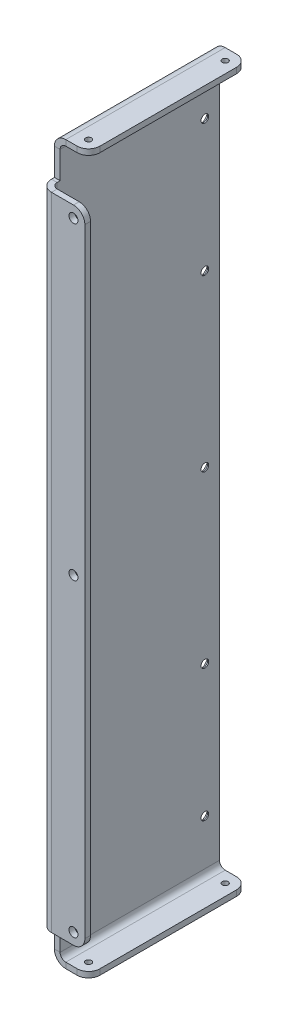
ISO-10303-21;
HEADER;
FILE_DESCRIPTION(('STEP AP214'),'2;1');
FILE_NAME('part.step','',(''),(''),'','','');
FILE_SCHEMA(('AUTOMOTIVE_DESIGN { 1 0 10303 214 1 1 1 1 }'));
ENDSEC;
DATA;
#1=APPLICATION_CONTEXT('core data for automotive mechanical design processes');
#2=APPLICATION_PROTOCOL_DEFINITION('international standard','automotive_design',2000,#1);
#3=PRODUCT_CONTEXT('',#1,'mechanical');
#4=PRODUCT('Part','Part','',(#3));
#5=PRODUCT_RELATED_PRODUCT_CATEGORY('part','',(#4));
#6=PRODUCT_DEFINITION_FORMATION('','',#4);
#7=PRODUCT_DEFINITION_CONTEXT('part definition',#1,'design');
#8=PRODUCT_DEFINITION('design','',#6,#7);
#9=PRODUCT_DEFINITION_SHAPE('','',#8);
#10=(LENGTH_UNIT() NAMED_UNIT(*) SI_UNIT(.MILLI.,.METRE.));
#11=(NAMED_UNIT(*) PLANE_ANGLE_UNIT() SI_UNIT($,.RADIAN.));
#12=(NAMED_UNIT(*) SI_UNIT($,.STERADIAN.) SOLID_ANGLE_UNIT());
#13=UNCERTAINTY_MEASURE_WITH_UNIT(LENGTH_MEASURE(1.E-05),#10,'distance_accuracy_value','');
#14=(GEOMETRIC_REPRESENTATION_CONTEXT(3) GLOBAL_UNCERTAINTY_ASSIGNED_CONTEXT((#13)) GLOBAL_UNIT_ASSIGNED_CONTEXT((#10,
#11,#12)) REPRESENTATION_CONTEXT('',''));
#15=CARTESIAN_POINT('',(0.,0.,0.));
#16=DIRECTION('',(0.,0.,1.));
#17=DIRECTION('',(1.,0.,0.));
#18=AXIS2_PLACEMENT_3D('',#15,#16,#17);
#19=CARTESIAN_POINT('',(0.,0.,8.));
#20=DIRECTION('',(0.,0.,-1.));
#21=DIRECTION('',(-1.,0.,0.));
#22=AXIS2_PLACEMENT_3D('',#19,#20,#21);
#23=PLANE('',#22);
#24=CARTESIAN_POINT('',(15.4750000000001,373.15,8.));
#25=DIRECTION('',(0.,0.,1.));
#26=DIRECTION('',(1.,0.,0.));
#27=AXIS2_PLACEMENT_3D('',#24,#25,#26);
#28=CIRCLE('',#27,2.5);
#29=CARTESIAN_POINT('',(17.9750000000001,373.15,8.));
#30=VERTEX_POINT('',#29);
#31=EDGE_CURVE('E1277',#30,#30,#28,.T.);
#32=ORIENTED_EDGE('',*,*,#31,.F.);
#33=EDGE_LOOP('',(#32));
#34=FACE_BOUND('',#33,.T.);
#35=CARTESIAN_POINT('',(15.4750000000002,200.5,8.));
#36=DIRECTION('',(0.,0.,1.));
#37=DIRECTION('',(1.,0.,0.));
#38=AXIS2_PLACEMENT_3D('',#35,#36,#37);
#39=CIRCLE('',#38,2.5);
#40=CARTESIAN_POINT('',(17.9750000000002,200.5,8.));
#41=VERTEX_POINT('',#40);
#42=EDGE_CURVE('E1283',#41,#41,#39,.T.);
#43=ORIENTED_EDGE('',*,*,#42,.F.);
#44=EDGE_LOOP('',(#43));
#45=FACE_BOUND('',#44,.T.);
#46=DIRECTION('',(0.,1.,0.));
#47=VECTOR('',#46,1.);
#48=CARTESIAN_POINT('',(21.8250000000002,0.,8.00000000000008));
#49=LINE('',#48,#47);
#50=CARTESIAN_POINT('',(21.8250000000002,27.85,8.00000000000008));
#51=VERTEX_POINT('',#50);
#52=CARTESIAN_POINT('',(21.8250000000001,373.15,8.00000000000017));
#53=VERTEX_POINT('',#52);
#54=EDGE_CURVE('E406',#51,#53,#49,.T.);
#55=ORIENTED_EDGE('',*,*,#54,.T.);
#56=CARTESIAN_POINT('',(15.4750000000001,373.15,8.00000000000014));
#57=DIRECTION('',(0.,0.,-1.));
#58=DIRECTION('',(-1.,0.,0.));
#59=AXIS2_PLACEMENT_3D('',#56,#57,#58);
#60=CIRCLE('',#59,6.35);
#61=CARTESIAN_POINT('',(15.4750000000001,379.5,8.00000000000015));
#62=VERTEX_POINT('',#61);
#63=EDGE_CURVE('E494',#53,#62,#60,.F.);
#64=ORIENTED_EDGE('',*,*,#63,.T.);
#65=DIRECTION('',(-1.,0.,0.));
#66=VECTOR('',#65,1.);
#67=CARTESIAN_POINT('',(0.,379.5,8.00000000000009));
#68=LINE('',#67,#66);
#69=CARTESIAN_POINT('',(3.17499999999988,379.5,8.0000000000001));
#70=VERTEX_POINT('',#69);
#71=EDGE_CURVE('E403',#62,#70,#68,.T.);
#72=ORIENTED_EDGE('',*,*,#71,.T.);
#73=DIRECTION('',(0.,-1.,0.));
#74=VECTOR('',#73,1.);
#75=CARTESIAN_POINT('',(3.1749999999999,379.5,8.0000000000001));
#76=LINE('',#75,#74);
#77=CARTESIAN_POINT('',(3.17500000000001,21.5,8.00000000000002));
#78=VERTEX_POINT('',#77);
#79=EDGE_CURVE('E420',#78,#70,#76,.F.);
#80=ORIENTED_EDGE('',*,*,#79,.F.);
#81=DIRECTION('',(1.,0.,0.));
#82=VECTOR('',#81,1.);
#83=CARTESIAN_POINT('',(0.,21.5,8.00000000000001));
#84=LINE('',#83,#82);
#85=CARTESIAN_POINT('',(15.4750000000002,21.5,8.00000000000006));
#86=VERTEX_POINT('',#85);
#87=EDGE_CURVE('E409',#78,#86,#84,.T.);
#88=ORIENTED_EDGE('',*,*,#87,.T.);
#89=CARTESIAN_POINT('',(15.4750000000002,27.85,8.00000000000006));
#90=DIRECTION('',(0.,0.,-1.));
#91=DIRECTION('',(-1.,0.,0.));
#92=AXIS2_PLACEMENT_3D('',#89,#90,#91);
#93=CIRCLE('',#92,6.35);
#94=EDGE_CURVE('E492',#86,#51,#93,.F.);
#95=ORIENTED_EDGE('',*,*,#94,.T.);
#96=EDGE_LOOP('',(#55,#64,#72,#80,#88,#95));
#97=FACE_BOUND('',#96,.T.);
#98=CARTESIAN_POINT('',(15.4750000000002,27.85,8.));
#99=DIRECTION('',(0.,0.,1.));
#100=DIRECTION('',(1.,0.,0.));
#101=AXIS2_PLACEMENT_3D('',#98,#99,#100);
#102=CIRCLE('',#101,2.5);
#103=CARTESIAN_POINT('',(17.9750000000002,27.85,8.));
#104=VERTEX_POINT('',#103);
#105=EDGE_CURVE('E1289',#104,#104,#102,.T.);
#106=ORIENTED_EDGE('',*,*,#105,.F.);
#107=EDGE_LOOP('',(#106));
#108=FACE_BOUND('',#107,.T.);
#109=ADVANCED_FACE('F113',(#34,#45,#97,#108),#23,.F.);
#110=CARTESIAN_POINT('',(-3.175,0.,0.));
#111=DIRECTION('',(-1.,0.,0.));
#112=DIRECTION('',(0.,0.,1.));
#113=AXIS2_PLACEMENT_3D('',#110,#111,#112);
#114=PLANE('',#113);
#115=CARTESIAN_POINT('',(-3.175,295.499999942,-80.8475001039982));
#116=DIRECTION('',(-1.,0.,0.));
#117=DIRECTION('',(0.,0.,1.));
#118=AXIS2_PLACEMENT_3D('',#115,#116,#117);
#119=CIRCLE('',#118,4.69999999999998);
#120=CARTESIAN_POINT('',(-3.175,295.499999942,-76.1475001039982));
#121=VERTEX_POINT('',#120);
#122=EDGE_CURVE('E1354',#121,#121,#119,.T.);
#123=ORIENTED_EDGE('',*,*,#122,.F.);
#124=EDGE_LOOP('',(#123));
#125=FACE_BOUND('',#124,.T.);
#126=CARTESIAN_POINT('',(-3.175,200.499999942,-80.8475001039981));
#127=DIRECTION('',(-1.,0.,0.));
#128=DIRECTION('',(0.,0.,1.));
#129=AXIS2_PLACEMENT_3D('',#126,#127,#128);
#130=CIRCLE('',#129,4.70000000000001);
#131=CARTESIAN_POINT('',(-3.175,200.499999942,-76.1475001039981));
#132=VERTEX_POINT('',#131);
#133=EDGE_CURVE('E1347',#132,#132,#130,.T.);
#134=ORIENTED_EDGE('',*,*,#133,.F.);
#135=EDGE_LOOP('',(#134));
#136=FACE_BOUND('',#135,.T.);
#137=CARTESIAN_POINT('',(-3.175,105.499999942,-80.8475001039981));
#138=DIRECTION('',(-1.,0.,0.));
#139=DIRECTION('',(0.,0.,1.));
#140=AXIS2_PLACEMENT_3D('',#137,#138,#139);
#141=CIRCLE('',#140,4.7);
#142=CARTESIAN_POINT('',(-3.175,105.499999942,-76.1475001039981));
#143=VERTEX_POINT('',#142);
#144=EDGE_CURVE('E1340',#143,#143,#141,.T.);
#145=ORIENTED_EDGE('',*,*,#144,.F.);
#146=EDGE_LOOP('',(#145));
#147=FACE_BOUND('',#146,.T.);
#148=CARTESIAN_POINT('',(-3.175,369.149999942,-80.8475001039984));
#149=DIRECTION('',(-1.,0.,0.));
#150=DIRECTION('',(0.,0.,1.));
#151=AXIS2_PLACEMENT_3D('',#148,#149,#150);
#152=CIRCLE('',#151,4.69999999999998);
#153=CARTESIAN_POINT('',(-3.175,369.149999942,-76.1475001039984));
#154=VERTEX_POINT('',#153);
#155=EDGE_CURVE('E1333',#154,#154,#152,.T.);
#156=ORIENTED_EDGE('',*,*,#155,.F.);
#157=EDGE_LOOP('',(#156));
#158=FACE_BOUND('',#157,.T.);
#159=CARTESIAN_POINT('',(-3.175,31.8499999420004,-80.8475001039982));
#160=DIRECTION('',(-1.,0.,0.));
#161=DIRECTION('',(0.,0.,1.));
#162=AXIS2_PLACEMENT_3D('',#159,#160,#161);
#163=CIRCLE('',#162,4.7);
#164=CARTESIAN_POINT('',(-3.175,31.8499999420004,-76.1475001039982));
#165=VERTEX_POINT('',#164);
#166=EDGE_CURVE('E1256',#165,#165,#163,.T.);
#167=ORIENTED_EDGE('',*,*,#166,.F.);
#168=EDGE_LOOP('',(#167));
#169=FACE_BOUND('',#168,.T.);
#170=DIRECTION('',(0.,1.,0.));
#171=VECTOR('',#170,1.);
#172=CARTESIAN_POINT('',(-3.175,0.,-89.000000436));
#173=LINE('',#172,#171);
#174=CARTESIAN_POINT('',(-3.17500000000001,6.34999999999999,-89.000000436));
#175=VERTEX_POINT('',#174);
#176=CARTESIAN_POINT('',(-3.175,394.65,-89.0000004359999));
#177=VERTEX_POINT('',#176);
#178=EDGE_CURVE('E471',#175,#177,#173,.T.);
#179=ORIENTED_EDGE('',*,*,#178,.F.);
#180=DIRECTION('',(0.,0.,-1.));
#181=VECTOR('',#180,1.);
#182=CARTESIAN_POINT('',(-3.17500000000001,6.34999999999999,-89.000000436));
#183=LINE('',#182,#181);
#184=CARTESIAN_POINT('',(-3.175,6.35,0.));
#185=VERTEX_POINT('',#184);
#186=EDGE_CURVE('E296',#175,#185,#183,.F.);
#187=ORIENTED_EDGE('',*,*,#186,.T.);
#188=DIRECTION('',(0.,-1.,0.));
#189=VECTOR('',#188,1.);
#190=CARTESIAN_POINT('',(-3.175,0.,0.));
#191=LINE('',#190,#189);
#192=CARTESIAN_POINT('',(-3.175,21.5000000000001,0.));
#193=VERTEX_POINT('',#192);
#194=EDGE_CURVE('E472',#193,#185,#191,.T.);
#195=ORIENTED_EDGE('',*,*,#194,.F.);
#196=DIRECTION('',(0.,0.,-1.));
#197=VECTOR('',#196,1.);
#198=CARTESIAN_POINT('',(-3.17499999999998,21.5,1.65000000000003));
#199=LINE('',#198,#197);
#200=CARTESIAN_POINT('',(-3.17499999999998,21.5,1.65000000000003));
#201=VERTEX_POINT('',#200);
#202=EDGE_CURVE('E462',#201,#193,#199,.T.);
#203=ORIENTED_EDGE('',*,*,#202,.F.);
#204=DIRECTION('',(0.,-1.,0.));
#205=VECTOR('',#204,1.);
#206=CARTESIAN_POINT('',(-3.17499999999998,21.5000000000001,1.65000000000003));
#207=LINE('',#206,#205);
#208=CARTESIAN_POINT('',(-3.17500000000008,379.5,1.65000000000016));
#209=VERTEX_POINT('',#208);
#210=EDGE_CURVE('E430',#201,#209,#207,.F.);
#211=ORIENTED_EDGE('',*,*,#210,.T.);
#212=DIRECTION('',(0.,0.,-1.));
#213=VECTOR('',#212,1.);
#214=CARTESIAN_POINT('',(-3.17500000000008,379.5,1.65000000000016));
#215=LINE('',#214,#213);
#216=CARTESIAN_POINT('',(-3.17500000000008,379.5,1.27695112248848E-13));
#217=VERTEX_POINT('',#216);
#218=EDGE_CURVE('E459',#209,#217,#215,.T.);
#219=ORIENTED_EDGE('',*,*,#218,.T.);
#220=CARTESIAN_POINT('',(-3.17499999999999,394.65,0.));
#221=VERTEX_POINT('',#220);
#222=EDGE_CURVE('E469',#221,#217,#191,.T.);
#223=ORIENTED_EDGE('',*,*,#222,.F.);
#224=DIRECTION('',(0.,0.,1.));
#225=VECTOR('',#224,1.);
#226=CARTESIAN_POINT('',(-3.17499999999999,394.65,0.));
#227=LINE('',#226,#225);
#228=EDGE_CURVE('E380',#221,#177,#227,.F.);
#229=ORIENTED_EDGE('',*,*,#228,.T.);
#230=EDGE_LOOP('',(#179,#187,#195,#203,#211,#219,#223,#229));
#231=FACE_BOUND('',#230,.T.);
#232=ADVANCED_FACE('F566',(#125,#136,#147,#158,#169,#231),#114,.T.);
#233=CARTESIAN_POINT('',(0.,0.,0.));
#234=DIRECTION('',(-1.,0.,0.));
#235=DIRECTION('',(0.,0.,1.));
#236=AXIS2_PLACEMENT_3D('',#233,#234,#235);
#237=PLANE('',#236);
#238=CARTESIAN_POINT('',(0.,295.499999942,-80.8475001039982));
#239=DIRECTION('',(-1.,0.,0.));
#240=DIRECTION('',(0.,0.,1.));
#241=AXIS2_PLACEMENT_3D('',#238,#239,#240);
#242=CIRCLE('',#241,2.14999999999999);
#243=CARTESIAN_POINT('',(0.,295.499999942,-78.6975001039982));
#244=VERTEX_POINT('',#243);
#245=EDGE_CURVE('E1233',#244,#244,#242,.T.);
#246=ORIENTED_EDGE('',*,*,#245,.T.);
#247=EDGE_LOOP('',(#246));
#248=FACE_BOUND('',#247,.T.);
#249=CARTESIAN_POINT('',(0.,200.499999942,-80.8475001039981));
#250=DIRECTION('',(-1.,0.,0.));
#251=DIRECTION('',(0.,0.,1.));
#252=AXIS2_PLACEMENT_3D('',#249,#250,#251);
#253=CIRCLE('',#252,2.15000000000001);
#254=CARTESIAN_POINT('',(0.,200.499999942,-78.6975001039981));
#255=VERTEX_POINT('',#254);
#256=EDGE_CURVE('E1237',#255,#255,#253,.T.);
#257=ORIENTED_EDGE('',*,*,#256,.T.);
#258=EDGE_LOOP('',(#257));
#259=FACE_BOUND('',#258,.T.);
#260=CARTESIAN_POINT('',(0.,105.499999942,-80.8475001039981));
#261=DIRECTION('',(-1.,0.,0.));
#262=DIRECTION('',(0.,0.,1.));
#263=AXIS2_PLACEMENT_3D('',#260,#261,#262);
#264=CIRCLE('',#263,2.15);
#265=CARTESIAN_POINT('',(0.,105.499999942,-78.6975001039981));
#266=VERTEX_POINT('',#265);
#267=EDGE_CURVE('E1241',#266,#266,#264,.T.);
#268=ORIENTED_EDGE('',*,*,#267,.T.);
#269=EDGE_LOOP('',(#268));
#270=FACE_BOUND('',#269,.T.);
#271=CARTESIAN_POINT('',(0.,369.149999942,-80.8475001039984));
#272=DIRECTION('',(-1.,0.,0.));
#273=DIRECTION('',(0.,0.,1.));
#274=AXIS2_PLACEMENT_3D('',#271,#272,#273);
#275=CIRCLE('',#274,2.14999999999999);
#276=CARTESIAN_POINT('',(0.,369.149999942,-78.6975001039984));
#277=VERTEX_POINT('',#276);
#278=EDGE_CURVE('E1245',#277,#277,#275,.T.);
#279=ORIENTED_EDGE('',*,*,#278,.T.);
#280=EDGE_LOOP('',(#279));
#281=FACE_BOUND('',#280,.T.);
#282=CARTESIAN_POINT('',(0.,31.8499999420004,-80.8475001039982));
#283=DIRECTION('',(-1.,0.,0.));
#284=DIRECTION('',(0.,0.,1.));
#285=AXIS2_PLACEMENT_3D('',#282,#283,#284);
#286=CIRCLE('',#285,2.15);
#287=CARTESIAN_POINT('',(0.,31.8499999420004,-78.6975001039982));
#288=VERTEX_POINT('',#287);
#289=EDGE_CURVE('E1248',#288,#288,#286,.T.);
#290=ORIENTED_EDGE('',*,*,#289,.T.);
#291=EDGE_LOOP('',(#290));
#292=FACE_BOUND('',#291,.T.);
#293=DIRECTION('',(0.,0.,-1.));
#294=VECTOR('',#293,1.);
#295=CARTESIAN_POINT('',(0.,6.34999999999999,-89.000000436));
#296=LINE('',#295,#294);
#297=CARTESIAN_POINT('',(0.,6.34999999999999,-89.000000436));
#298=VERTEX_POINT('',#297);
#299=CARTESIAN_POINT('',(0.,6.35,0.));
#300=VERTEX_POINT('',#299);
#301=EDGE_CURVE('E349',#298,#300,#296,.F.);
#302=ORIENTED_EDGE('',*,*,#301,.F.);
#303=DIRECTION('',(0.,1.,0.));
#304=VECTOR('',#303,1.);
#305=CARTESIAN_POINT('',(0.,0.,-89.000000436));
#306=LINE('',#305,#304);
#307=CARTESIAN_POINT('',(0.,394.65,-89.0000004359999));
#308=VERTEX_POINT('',#307);
#309=EDGE_CURVE('E478',#298,#308,#306,.T.);
#310=ORIENTED_EDGE('',*,*,#309,.T.);
#311=DIRECTION('',(0.,0.,1.));
#312=VECTOR('',#311,1.);
#313=CARTESIAN_POINT('',(0.,394.65,0.));
#314=LINE('',#313,#312);
#315=CARTESIAN_POINT('',(0.,394.65,0.));
#316=VERTEX_POINT('',#315);
#317=EDGE_CURVE('E393',#316,#308,#314,.F.);
#318=ORIENTED_EDGE('',*,*,#317,.F.);
#319=DIRECTION('',(0.,-1.,0.));
#320=VECTOR('',#319,1.);
#321=CARTESIAN_POINT('',(0.,0.,0.));
#322=LINE('',#321,#320);
#323=CARTESIAN_POINT('',(0.,379.5,1.09697356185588E-13));
#324=VERTEX_POINT('',#323);
#325=EDGE_CURVE('E476',#316,#324,#322,.T.);
#326=ORIENTED_EDGE('',*,*,#325,.T.);
#327=DIRECTION('',(0.,0.,-1.));
#328=VECTOR('',#327,1.);
#329=CARTESIAN_POINT('',(0.,379.5,1.65000000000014));
#330=LINE('',#329,#328);
#331=CARTESIAN_POINT('',(0.,379.5,1.65000000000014));
#332=VERTEX_POINT('',#331);
#333=EDGE_CURVE('E458',#332,#324,#330,.T.);
#334=ORIENTED_EDGE('',*,*,#333,.F.);
#335=DIRECTION('',(0.,-1.,0.));
#336=VECTOR('',#335,1.);
#337=CARTESIAN_POINT('',(0.,21.5000000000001,1.65000000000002));
#338=LINE('',#337,#336);
#339=CARTESIAN_POINT('',(0.,21.5,1.65000000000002));
#340=VERTEX_POINT('',#339);
#341=EDGE_CURVE('E443',#340,#332,#338,.F.);
#342=ORIENTED_EDGE('',*,*,#341,.F.);
#343=DIRECTION('',(0.,0.,-1.));
#344=VECTOR('',#343,1.);
#345=CARTESIAN_POINT('',(0.,21.5,1.65000000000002));
#346=LINE('',#345,#344);
#347=CARTESIAN_POINT('',(0.,21.5000000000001,0.));
#348=VERTEX_POINT('',#347);
#349=EDGE_CURVE('E464',#340,#348,#346,.T.);
#350=ORIENTED_EDGE('',*,*,#349,.T.);
#351=EDGE_CURVE('E466',#348,#300,#322,.T.);
#352=ORIENTED_EDGE('',*,*,#351,.T.);
#353=EDGE_LOOP('',(#302,#310,#318,#326,#334,#342,#350,#352));
#354=FACE_BOUND('',#353,.T.);
#355=ADVANCED_FACE('F577',(#248,#259,#270,#281,#292,#354),#237,.F.);
#356=CARTESIAN_POINT('',(-3.175,0.,-89.000000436));
#357=DIRECTION('',(0.,0.,-1.));
#358=DIRECTION('',(0.,1.,0.));
#359=AXIS2_PLACEMENT_3D('',#356,#357,#358);
#360=PLANE('',#359);
#361=ORIENTED_EDGE('',*,*,#309,.F.);
#362=DIRECTION('',(-1.,0.,0.));
#363=VECTOR('',#362,1.);
#364=CARTESIAN_POINT('',(0.,6.34999999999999,-89.000000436));
#365=LINE('',#364,#363);
#366=EDGE_CURVE('E345',#298,#175,#365,.T.);
#367=ORIENTED_EDGE('',*,*,#366,.T.);
#368=ORIENTED_EDGE('',*,*,#178,.T.);
#369=DIRECTION('',(-1.,0.,0.));
#370=VECTOR('',#369,1.);
#371=CARTESIAN_POINT('',(0.,394.65,-89.0000004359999));
#372=LINE('',#371,#370);
#373=EDGE_CURVE('E397',#308,#177,#372,.T.);
#374=ORIENTED_EDGE('',*,*,#373,.F.);
#375=EDGE_LOOP('',(#361,#367,#368,#374));
#376=FACE_BOUND('',#375,.T.);
#377=ADVANCED_FACE('F563',(#376),#360,.T.);
#378=CARTESIAN_POINT('',(-3.175,0.,0.));
#379=DIRECTION('',(0.,0.,1.));
#380=DIRECTION('',(0.,-1.,0.));
#381=AXIS2_PLACEMENT_3D('',#378,#379,#380);
#382=PLANE('',#381);
#383=ORIENTED_EDGE('',*,*,#325,.F.);
#384=DIRECTION('',(-1.,0.,0.));
#385=VECTOR('',#384,1.);
#386=CARTESIAN_POINT('',(0.,394.65,0.));
#387=LINE('',#386,#385);
#388=EDGE_CURVE('E387',#316,#221,#387,.T.);
#389=ORIENTED_EDGE('',*,*,#388,.T.);
#390=ORIENTED_EDGE('',*,*,#222,.T.);
#391=DIRECTION('',(-1.,0.,0.));
#392=VECTOR('',#391,1.);
#393=CARTESIAN_POINT('',(0.,379.5,1.09697356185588E-13));
#394=LINE('',#393,#392);
#395=EDGE_CURVE('E450',#324,#217,#394,.T.);
#396=ORIENTED_EDGE('',*,*,#395,.F.);
#397=EDGE_LOOP('',(#383,#389,#390,#396));
#398=FACE_BOUND('',#397,.T.);
#399=ADVANCED_FACE('F571',(#398),#382,.T.);
#400=DIRECTION('',(-1.,0.,0.));
#401=VECTOR('',#400,1.);
#402=CARTESIAN_POINT('',(0.,6.35,0.));
#403=LINE('',#402,#401);
#404=EDGE_CURVE('E352',#300,#185,#403,.T.);
#405=ORIENTED_EDGE('',*,*,#404,.F.);
#406=ORIENTED_EDGE('',*,*,#351,.F.);
#407=DIRECTION('',(-1.,0.,0.));
#408=VECTOR('',#407,1.);
#409=CARTESIAN_POINT('',(0.,21.5000000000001,0.));
#410=LINE('',#409,#408);
#411=EDGE_CURVE('E455',#348,#193,#410,.T.);
#412=ORIENTED_EDGE('',*,*,#411,.T.);
#413=ORIENTED_EDGE('',*,*,#194,.T.);
#414=EDGE_LOOP('',(#405,#406,#412,#413));
#415=FACE_BOUND('',#414,.T.);
#416=ADVANCED_FACE('F591',(#415),#382,.T.);
#417=CARTESIAN_POINT('',(0.,21.5,1.65000000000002));
#418=DIRECTION('',(0.,-1.,0.));
#419=DIRECTION('',(-1.,0.,0.));
#420=AXIS2_PLACEMENT_3D('',#417,#418,#419);
#421=PLANE('',#420);
#422=ORIENTED_EDGE('',*,*,#349,.F.);
#423=DIRECTION('',(-1.,0.,0.));
#424=VECTOR('',#423,1.);
#425=CARTESIAN_POINT('',(0.,21.5,1.65000000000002));
#426=LINE('',#425,#424);
#427=EDGE_CURVE('E437',#340,#201,#426,.T.);
#428=ORIENTED_EDGE('',*,*,#427,.T.);
#429=ORIENTED_EDGE('',*,*,#202,.T.);
#430=ORIENTED_EDGE('',*,*,#411,.F.);
#431=EDGE_LOOP('',(#422,#428,#429,#430));
#432=FACE_BOUND('',#431,.T.);
#433=ADVANCED_FACE('F597',(#432),#421,.T.);
#434=CARTESIAN_POINT('',(0.,379.5,1.65000000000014));
#435=DIRECTION('',(0.,-1.,0.));
#436=DIRECTION('',(-1.,0.,0.));
#437=AXIS2_PLACEMENT_3D('',#434,#435,#436);
#438=PLANE('',#437);
#439=ORIENTED_EDGE('',*,*,#218,.F.);
#440=DIRECTION('',(-1.,0.,0.));
#441=VECTOR('',#440,1.);
#442=CARTESIAN_POINT('',(0.,379.5,1.65000000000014));
#443=LINE('',#442,#441);
#444=EDGE_CURVE('E447',#332,#209,#443,.T.);
#445=ORIENTED_EDGE('',*,*,#444,.F.);
#446=ORIENTED_EDGE('',*,*,#333,.T.);
#447=ORIENTED_EDGE('',*,*,#395,.T.);
#448=EDGE_LOOP('',(#439,#445,#446,#447));
#449=FACE_BOUND('',#448,.T.);
#450=ADVANCED_FACE('F1189',(#449),#438,.F.);
#451=CARTESIAN_POINT('',(3.17499999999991,379.5,1.65000000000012));
#452=DIRECTION('',(0.,1.,0.));
#453=DIRECTION('',(0.,0.,1.));
#454=AXIS2_PLACEMENT_3D('',#451,#452,#453);
#455=PLANE('',#454);
#456=DIRECTION('',(0.,0.,-1.));
#457=VECTOR('',#456,1.);
#458=CARTESIAN_POINT('',(3.1749999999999,379.5,8.00000000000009));
#459=LINE('',#458,#457);
#460=CARTESIAN_POINT('',(3.17499999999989,379.5,4.8250000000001));
#461=VERTEX_POINT('',#460);
#462=EDGE_CURVE('E400',#461,#70,#459,.F.);
#463=ORIENTED_EDGE('',*,*,#462,.F.);
#464=CARTESIAN_POINT('',(3.17499999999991,379.5,1.65000000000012));
#465=DIRECTION('',(0.,-1.,0.));
#466=DIRECTION('',(0.,0.,-1.));
#467=AXIS2_PLACEMENT_3D('',#464,#465,#466);
#468=CIRCLE('',#467,3.17499999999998);
#469=EDGE_CURVE('E440',#332,#461,#468,.F.);
#470=ORIENTED_EDGE('',*,*,#469,.F.);
#471=ORIENTED_EDGE('',*,*,#444,.T.);
#472=CARTESIAN_POINT('',(3.17499999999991,379.5,1.65000000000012));
#473=DIRECTION('',(0.,-1.,0.));
#474=DIRECTION('',(0.,0.,-1.));
#475=AXIS2_PLACEMENT_3D('',#472,#473,#474);
#476=CIRCLE('',#475,6.34999999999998);
#477=EDGE_CURVE('E433',#209,#70,#476,.F.);
#478=ORIENTED_EDGE('',*,*,#477,.T.);
#479=EDGE_LOOP('',(#463,#470,#471,#478));
#480=FACE_BOUND('',#479,.T.);
#481=ADVANCED_FACE('F636',(#480),#455,.T.);
#482=CARTESIAN_POINT('',(3.175,21.5,1.65));
#483=DIRECTION('',(0.,1.,0.));
#484=DIRECTION('',(0.,0.,1.));
#485=AXIS2_PLACEMENT_3D('',#482,#483,#484);
#486=PLANE('',#485);
#487=CARTESIAN_POINT('',(3.175,21.5,1.65));
#488=DIRECTION('',(0.,-1.,0.));
#489=DIRECTION('',(0.,0.,-1.));
#490=AXIS2_PLACEMENT_3D('',#487,#488,#489);
#491=CIRCLE('',#490,3.17499999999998);
#492=CARTESIAN_POINT('',(3.17499999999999,21.5,4.82499999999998));
#493=VERTEX_POINT('',#492);
#494=EDGE_CURVE('E405',#493,#340,#491,.T.);
#495=ORIENTED_EDGE('',*,*,#494,.F.);
#496=DIRECTION('',(0.,0.,-1.));
#497=VECTOR('',#496,1.);
#498=CARTESIAN_POINT('',(3.17500000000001,21.5,4.82500000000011));
#499=LINE('',#498,#497);
#500=EDGE_CURVE('E423',#493,#78,#499,.F.);
#501=ORIENTED_EDGE('',*,*,#500,.T.);
#502=CARTESIAN_POINT('',(3.175,21.5,1.65));
#503=DIRECTION('',(0.,-1.,0.));
#504=DIRECTION('',(0.,0.,-1.));
#505=AXIS2_PLACEMENT_3D('',#502,#503,#504);
#506=CIRCLE('',#505,6.34999999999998);
#507=EDGE_CURVE('E434',#78,#201,#506,.T.);
#508=ORIENTED_EDGE('',*,*,#507,.T.);
#509=ORIENTED_EDGE('',*,*,#427,.F.);
#510=EDGE_LOOP('',(#495,#501,#508,#509));
#511=FACE_BOUND('',#510,.T.);
#512=ADVANCED_FACE('F601',(#511),#486,.F.);
#513=CARTESIAN_POINT('',(3.175,21.5000000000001,1.65));
#514=DIRECTION('',(0.,-1.,0.));
#515=DIRECTION('',(0.,0.,1.));
#516=AXIS2_PLACEMENT_3D('',#513,#514,#515);
#517=CYLINDRICAL_SURFACE('',#516,6.34999999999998);
#518=ORIENTED_EDGE('',*,*,#210,.F.);
#519=ORIENTED_EDGE('',*,*,#507,.F.);
#520=ORIENTED_EDGE('',*,*,#79,.T.);
#521=ORIENTED_EDGE('',*,*,#477,.F.);
#522=EDGE_LOOP('',(#518,#519,#520,#521));
#523=FACE_BOUND('',#522,.T.);
#524=ADVANCED_FACE('F639',(#523),#517,.T.);
#525=CARTESIAN_POINT('',(3.175,21.5000000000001,1.65));
#526=DIRECTION('',(0.,-1.,0.));
#527=DIRECTION('',(0.,0.,1.));
#528=AXIS2_PLACEMENT_3D('',#525,#526,#527);
#529=CYLINDRICAL_SURFACE('',#528,3.17499999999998);
#530=ORIENTED_EDGE('',*,*,#341,.T.);
#531=ORIENTED_EDGE('',*,*,#469,.T.);
#532=DIRECTION('',(0.,-1.,0.));
#533=VECTOR('',#532,1.);
#534=CARTESIAN_POINT('',(3.1749999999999,379.5,4.8250000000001));
#535=LINE('',#534,#533);
#536=EDGE_CURVE('E426',#461,#493,#535,.T.);
#537=ORIENTED_EDGE('',*,*,#536,.T.);
#538=ORIENTED_EDGE('',*,*,#494,.T.);
#539=EDGE_LOOP('',(#530,#531,#537,#538));
#540=FACE_BOUND('',#539,.T.);
#541=ADVANCED_FACE('F604',(#540),#529,.F.);
#542=CARTESIAN_POINT('',(21.8250000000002,21.5,8.00000000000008));
#543=DIRECTION('',(0.,1.,0.));
#544=DIRECTION('',(0.,0.,1.));
#545=AXIS2_PLACEMENT_3D('',#542,#543,#544);
#546=PLANE('',#545);
#547=DIRECTION('',(-1.,0.,0.));
#548=VECTOR('',#547,1.);
#549=CARTESIAN_POINT('',(21.8250000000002,21.5,4.82500000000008));
#550=LINE('',#549,#548);
#551=CARTESIAN_POINT('',(15.4750000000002,21.5,4.82500000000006));
#552=VERTEX_POINT('',#551);
#553=EDGE_CURVE('E417',#493,#552,#550,.F.);
#554=ORIENTED_EDGE('',*,*,#553,.T.);
#555=DIRECTION('',(0.,0.,-1.));
#556=VECTOR('',#555,1.);
#557=CARTESIAN_POINT('',(15.4750000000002,21.5,8.00000000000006));
#558=LINE('',#557,#556);
#559=EDGE_CURVE('E496',#552,#86,#558,.F.);
#560=ORIENTED_EDGE('',*,*,#559,.T.);
#561=ORIENTED_EDGE('',*,*,#87,.F.);
#562=ORIENTED_EDGE('',*,*,#500,.F.);
#563=EDGE_LOOP('',(#554,#560,#561,#562));
#564=FACE_BOUND('',#563,.T.);
#565=ADVANCED_FACE('F614',(#564),#546,.F.);
#566=CARTESIAN_POINT('',(0.,379.5,8.00000000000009));
#567=DIRECTION('',(0.,-1.,0.));
#568=DIRECTION('',(0.,0.,-1.));
#569=AXIS2_PLACEMENT_3D('',#566,#567,#568);
#570=PLANE('',#569);
#571=ORIENTED_EDGE('',*,*,#71,.F.);
#572=DIRECTION('',(0.,0.,-1.));
#573=VECTOR('',#572,1.);
#574=CARTESIAN_POINT('',(15.4750000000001,379.5,8.00000000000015));
#575=LINE('',#574,#573);
#576=CARTESIAN_POINT('',(15.4750000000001,379.5,4.82500000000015));
#577=VERTEX_POINT('',#576);
#578=EDGE_CURVE('E475',#62,#577,#575,.T.);
#579=ORIENTED_EDGE('',*,*,#578,.T.);
#580=DIRECTION('',(1.,0.,0.));
#581=VECTOR('',#580,1.);
#582=CARTESIAN_POINT('',(0.,379.5,4.82500000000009));
#583=LINE('',#582,#581);
#584=EDGE_CURVE('E412',#577,#461,#583,.F.);
#585=ORIENTED_EDGE('',*,*,#584,.T.);
#586=ORIENTED_EDGE('',*,*,#462,.T.);
#587=EDGE_LOOP('',(#571,#579,#585,#586));
#588=FACE_BOUND('',#587,.T.);
#589=ADVANCED_FACE('F633',(#588),#570,.F.);
#590=CARTESIAN_POINT('',(0.,0.,4.825));
#591=DIRECTION('',(0.,0.,-1.));
#592=DIRECTION('',(-1.,0.,0.));
#593=AXIS2_PLACEMENT_3D('',#590,#591,#592);
#594=PLANE('',#593);
#595=CARTESIAN_POINT('',(15.4750000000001,373.15,4.82500000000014));
#596=DIRECTION('',(0.,0.,-1.));
#597=DIRECTION('',(-1.,0.,0.));
#598=AXIS2_PLACEMENT_3D('',#595,#596,#597);
#599=CIRCLE('',#598,2.5);
#600=CARTESIAN_POINT('',(12.9750000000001,373.15,4.82500000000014));
#601=VERTEX_POINT('',#600);
#602=EDGE_CURVE('E1280',#601,#601,#599,.T.);
#603=ORIENTED_EDGE('',*,*,#602,.F.);
#604=EDGE_LOOP('',(#603));
#605=FACE_BOUND('',#604,.T.);
#606=CARTESIAN_POINT('',(15.4750000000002,200.5,4.8250000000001));
#607=DIRECTION('',(0.,0.,-1.));
#608=DIRECTION('',(-1.,0.,0.));
#609=AXIS2_PLACEMENT_3D('',#606,#607,#608);
#610=CIRCLE('',#609,2.5);
#611=CARTESIAN_POINT('',(12.9750000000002,200.5,4.8250000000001));
#612=VERTEX_POINT('',#611);
#613=EDGE_CURVE('E1286',#612,#612,#610,.T.);
#614=ORIENTED_EDGE('',*,*,#613,.F.);
#615=EDGE_LOOP('',(#614));
#616=FACE_BOUND('',#615,.T.);
#617=CARTESIAN_POINT('',(15.4750000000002,27.85,4.82500000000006));
#618=DIRECTION('',(0.,0.,-1.));
#619=DIRECTION('',(-1.,0.,0.));
#620=AXIS2_PLACEMENT_3D('',#617,#618,#619);
#621=CIRCLE('',#620,2.5);
#622=CARTESIAN_POINT('',(12.9750000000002,27.85,4.82500000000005));
#623=VERTEX_POINT('',#622);
#624=EDGE_CURVE('E342',#623,#623,#621,.T.);
#625=ORIENTED_EDGE('',*,*,#624,.F.);
#626=EDGE_LOOP('',(#625));
#627=FACE_BOUND('',#626,.T.);
#628=ORIENTED_EDGE('',*,*,#584,.F.);
#629=CARTESIAN_POINT('',(15.4750000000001,373.15,4.82500000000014));
#630=DIRECTION('',(0.,0.,-1.));
#631=DIRECTION('',(-1.,0.,0.));
#632=AXIS2_PLACEMENT_3D('',#629,#630,#631);
#633=CIRCLE('',#632,6.35);
#634=CARTESIAN_POINT('',(21.8250000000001,373.15,4.82500000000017));
#635=VERTEX_POINT('',#634);
#636=EDGE_CURVE('E485',#577,#635,#633,.T.);
#637=ORIENTED_EDGE('',*,*,#636,.T.);
#638=DIRECTION('',(0.,-1.,0.));
#639=VECTOR('',#638,1.);
#640=CARTESIAN_POINT('',(21.8250000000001,379.5,4.82500000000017));
#641=LINE('',#640,#639);
#642=CARTESIAN_POINT('',(21.8250000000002,27.85,4.82500000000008));
#643=VERTEX_POINT('',#642);
#644=EDGE_CURVE('E414',#643,#635,#641,.F.);
#645=ORIENTED_EDGE('',*,*,#644,.F.);
#646=CARTESIAN_POINT('',(15.4750000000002,27.85,4.82500000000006));
#647=DIRECTION('',(0.,0.,-1.));
#648=DIRECTION('',(-1.,0.,0.));
#649=AXIS2_PLACEMENT_3D('',#646,#647,#648);
#650=CIRCLE('',#649,6.35);
#651=EDGE_CURVE('E483',#643,#552,#650,.T.);
#652=ORIENTED_EDGE('',*,*,#651,.T.);
#653=ORIENTED_EDGE('',*,*,#553,.F.);
#654=ORIENTED_EDGE('',*,*,#536,.F.);
#655=EDGE_LOOP('',(#628,#637,#645,#652,#653,#654));
#656=FACE_BOUND('',#655,.T.);
#657=ADVANCED_FACE('F610',(#605,#616,#627,#656),#594,.T.);
#658=CARTESIAN_POINT('',(21.8250000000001,379.5,8.00000000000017));
#659=DIRECTION('',(-1.,0.,0.));
#660=DIRECTION('',(0.,0.,1.));
#661=AXIS2_PLACEMENT_3D('',#658,#659,#660);
#662=PLANE('',#661);
#663=ORIENTED_EDGE('',*,*,#644,.T.);
#664=DIRECTION('',(0.,0.,-1.));
#665=VECTOR('',#664,1.);
#666=CARTESIAN_POINT('',(21.8250000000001,373.15,8.00000000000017));
#667=LINE('',#666,#665);
#668=EDGE_CURVE('E490',#635,#53,#667,.F.);
#669=ORIENTED_EDGE('',*,*,#668,.T.);
#670=ORIENTED_EDGE('',*,*,#54,.F.);
#671=DIRECTION('',(0.,0.,-1.));
#672=VECTOR('',#671,1.);
#673=CARTESIAN_POINT('',(21.8250000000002,27.85,8.00000000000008));
#674=LINE('',#673,#672);
#675=EDGE_CURVE('E487',#51,#643,#674,.T.);
#676=ORIENTED_EDGE('',*,*,#675,.T.);
#677=EDGE_LOOP('',(#663,#669,#670,#676));
#678=FACE_BOUND('',#677,.T.);
#679=ADVANCED_FACE('F626',(#678),#662,.F.);
#680=CARTESIAN_POINT('',(3.17499999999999,394.65,-89.0000004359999));
#681=DIRECTION('',(0.,0.,-1.));
#682=DIRECTION('',(-1.,0.,0.));
#683=AXIS2_PLACEMENT_3D('',#680,#681,#682);
#684=PLANE('',#683);
#685=DIRECTION('',(0.,-1.,0.));
#686=VECTOR('',#685,1.);
#687=CARTESIAN_POINT('',(3.17499999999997,401.,-89.0000004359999));
#688=LINE('',#687,#686);
#689=CARTESIAN_POINT('',(3.17499999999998,397.825,-89.0000004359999));
#690=VERTEX_POINT('',#689);
#691=CARTESIAN_POINT('',(3.17499999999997,401.,-89.0000004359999));
#692=VERTEX_POINT('',#691);
#693=EDGE_CURVE('E355',#690,#692,#688,.F.);
#694=ORIENTED_EDGE('',*,*,#693,.F.);
#695=CARTESIAN_POINT('',(3.17499999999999,394.65,-89.0000004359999));
#696=DIRECTION('',(0.,0.,1.));
#697=DIRECTION('',(1.,0.,0.));
#698=AXIS2_PLACEMENT_3D('',#695,#696,#697);
#699=CIRCLE('',#698,3.17499999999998);
#700=EDGE_CURVE('E390',#308,#690,#699,.F.);
#701=ORIENTED_EDGE('',*,*,#700,.F.);
#702=ORIENTED_EDGE('',*,*,#373,.T.);
#703=CARTESIAN_POINT('',(3.17499999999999,394.65,-89.0000004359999));
#704=DIRECTION('',(0.,0.,1.));
#705=DIRECTION('',(1.,0.,0.));
#706=AXIS2_PLACEMENT_3D('',#703,#704,#705);
#707=CIRCLE('',#706,6.34999999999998);
#708=EDGE_CURVE('E383',#177,#692,#707,.F.);
#709=ORIENTED_EDGE('',*,*,#708,.T.);
#710=EDGE_LOOP('',(#694,#701,#702,#709));
#711=FACE_BOUND('',#710,.T.);
#712=ADVANCED_FACE('F557',(#711),#684,.T.);
#713=CARTESIAN_POINT('',(3.17499999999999,394.65,0.));
#714=DIRECTION('',(0.,0.,-1.));
#715=DIRECTION('',(-1.,0.,0.));
#716=AXIS2_PLACEMENT_3D('',#713,#714,#715);
#717=PLANE('',#716);
#718=CARTESIAN_POINT('',(3.17499999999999,394.65,0.));
#719=DIRECTION('',(0.,0.,1.));
#720=DIRECTION('',(1.,0.,0.));
#721=AXIS2_PLACEMENT_3D('',#718,#719,#720);
#722=CIRCLE('',#721,3.17499999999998);
#723=CARTESIAN_POINT('',(3.17499999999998,397.825,0.));
#724=VERTEX_POINT('',#723);
#725=EDGE_CURVE('E359',#724,#316,#722,.T.);
#726=ORIENTED_EDGE('',*,*,#725,.F.);
#727=DIRECTION('',(0.,-1.,0.));
#728=VECTOR('',#727,1.);
#729=CARTESIAN_POINT('',(3.17499999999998,397.825,0.));
#730=LINE('',#729,#728);
#731=CARTESIAN_POINT('',(3.17499999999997,401.,0.));
#732=VERTEX_POINT('',#731);
#733=EDGE_CURVE('E373',#724,#732,#730,.F.);
#734=ORIENTED_EDGE('',*,*,#733,.T.);
#735=CARTESIAN_POINT('',(3.17499999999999,394.65,0.));
#736=DIRECTION('',(0.,0.,1.));
#737=DIRECTION('',(1.,0.,0.));
#738=AXIS2_PLACEMENT_3D('',#735,#736,#737);
#739=CIRCLE('',#738,6.34999999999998);
#740=EDGE_CURVE('E384',#732,#221,#739,.T.);
#741=ORIENTED_EDGE('',*,*,#740,.T.);
#742=ORIENTED_EDGE('',*,*,#388,.F.);
#743=EDGE_LOOP('',(#726,#734,#741,#742));
#744=FACE_BOUND('',#743,.T.);
#745=ADVANCED_FACE('F553',(#744),#717,.F.);
#746=CARTESIAN_POINT('',(3.17499999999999,394.65,0.));
#747=DIRECTION('',(0.,0.,1.));
#748=DIRECTION('',(0.,1.,0.));
#749=AXIS2_PLACEMENT_3D('',#746,#747,#748);
#750=CYLINDRICAL_SURFACE('',#749,6.34999999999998);
#751=ORIENTED_EDGE('',*,*,#228,.F.);
#752=ORIENTED_EDGE('',*,*,#740,.F.);
#753=DIRECTION('',(0.,0.,1.));
#754=VECTOR('',#753,1.);
#755=CARTESIAN_POINT('',(3.17499999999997,401.,-89.0000004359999));
#756=LINE('',#755,#754);
#757=EDGE_CURVE('E370',#732,#692,#756,.F.);
#758=ORIENTED_EDGE('',*,*,#757,.T.);
#759=ORIENTED_EDGE('',*,*,#708,.F.);
#760=EDGE_LOOP('',(#751,#752,#758,#759));
#761=FACE_BOUND('',#760,.T.);
#762=ADVANCED_FACE('F555',(#761),#750,.T.);
#763=CARTESIAN_POINT('',(3.17499999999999,394.65,0.));
#764=DIRECTION('',(0.,0.,1.));
#765=DIRECTION('',(0.,1.,0.));
#766=AXIS2_PLACEMENT_3D('',#763,#764,#765);
#767=CYLINDRICAL_SURFACE('',#766,3.17499999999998);
#768=ORIENTED_EDGE('',*,*,#317,.T.);
#769=ORIENTED_EDGE('',*,*,#700,.T.);
#770=DIRECTION('',(0.,0.,1.));
#771=VECTOR('',#770,1.);
#772=CARTESIAN_POINT('',(3.17499999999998,397.825,-89.0000004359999));
#773=LINE('',#772,#771);
#774=EDGE_CURVE('E376',#690,#724,#773,.T.);
#775=ORIENTED_EDGE('',*,*,#774,.T.);
#776=ORIENTED_EDGE('',*,*,#725,.T.);
#777=EDGE_LOOP('',(#768,#769,#775,#776));
#778=FACE_BOUND('',#777,.T.);
#779=ADVANCED_FACE('F574',(#778),#767,.F.);
#780=CARTESIAN_POINT('',(0.,401.,-89.0000004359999));
#781=DIRECTION('',(0.,0.,1.));
#782=DIRECTION('',(1.,0.,0.));
#783=AXIS2_PLACEMENT_3D('',#780,#781,#782);
#784=PLANE('',#783);
#785=DIRECTION('',(-1.,0.,0.));
#786=VECTOR('',#785,1.);
#787=CARTESIAN_POINT('',(-1.56889445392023E-12,401.,-89.0000004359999));
#788=LINE('',#787,#786);
#789=CARTESIAN_POINT('',(9.52499999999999,401.,-89.0000004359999));
#790=VERTEX_POINT('',#789);
#791=EDGE_CURVE('E362',#790,#692,#788,.T.);
#792=ORIENTED_EDGE('',*,*,#791,.F.);
#793=DIRECTION('',(0.,-1.,0.));
#794=VECTOR('',#793,1.);
#795=CARTESIAN_POINT('',(9.52499999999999,401.,-89.0000004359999));
#796=LINE('',#795,#794);
#797=CARTESIAN_POINT('',(9.525,397.825,-89.0000004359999));
#798=VERTEX_POINT('',#797);
#799=EDGE_CURVE('E515',#790,#798,#796,.T.);
#800=ORIENTED_EDGE('',*,*,#799,.T.);
#801=DIRECTION('',(1.,0.,0.));
#802=VECTOR('',#801,1.);
#803=CARTESIAN_POINT('',(0.,397.825,-89.0000004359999));
#804=LINE('',#803,#802);
#805=EDGE_CURVE('E368',#798,#690,#804,.F.);
#806=ORIENTED_EDGE('',*,*,#805,.T.);
#807=ORIENTED_EDGE('',*,*,#693,.T.);
#808=EDGE_LOOP('',(#792,#800,#806,#807));
#809=FACE_BOUND('',#808,.T.);
#810=ADVANCED_FACE('F536',(#809),#784,.F.);
#811=CARTESIAN_POINT('',(15.875,401.,0.));
#812=DIRECTION('',(0.,0.,-1.));
#813=DIRECTION('',(-1.,0.,0.));
#814=AXIS2_PLACEMENT_3D('',#811,#812,#813);
#815=PLANE('',#814);
#816=DIRECTION('',(-1.,0.,0.));
#817=VECTOR('',#816,1.);
#818=CARTESIAN_POINT('',(15.875,397.825,0.));
#819=LINE('',#818,#817);
#820=CARTESIAN_POINT('',(9.52500000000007,397.825,0.));
#821=VERTEX_POINT('',#820);
#822=EDGE_CURVE('E366',#724,#821,#819,.F.);
#823=ORIENTED_EDGE('',*,*,#822,.T.);
#824=DIRECTION('',(0.,-1.,0.));
#825=VECTOR('',#824,1.);
#826=CARTESIAN_POINT('',(9.52500000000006,401.,0.));
#827=LINE('',#826,#825);
#828=CARTESIAN_POINT('',(9.52500000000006,401.,0.));
#829=VERTEX_POINT('',#828);
#830=EDGE_CURVE('E13',#821,#829,#827,.F.);
#831=ORIENTED_EDGE('',*,*,#830,.T.);
#832=DIRECTION('',(1.,0.,0.));
#833=VECTOR('',#832,1.);
#834=CARTESIAN_POINT('',(-1.41328839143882E-12,401.,0.));
#835=LINE('',#834,#833);
#836=EDGE_CURVE('E360',#732,#829,#835,.T.);
#837=ORIENTED_EDGE('',*,*,#836,.F.);
#838=ORIENTED_EDGE('',*,*,#733,.F.);
#839=EDGE_LOOP('',(#823,#831,#837,#838));
#840=FACE_BOUND('',#839,.T.);
#841=ADVANCED_FACE('F550',(#840),#815,.F.);
#842=CARTESIAN_POINT('',(-1.41328839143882E-12,401.,0.));
#843=DIRECTION('',(0.,-1.,0.));
#844=DIRECTION('',(1.,0.,0.));
#845=AXIS2_PLACEMENT_3D('',#842,#843,#844);
#846=PLANE('',#845);
#847=CARTESIAN_POINT('',(9.525,401.,-82.6500004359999));
#848=DIRECTION('',(0.,1.,0.));
#849=DIRECTION('',(0.,0.,1.));
#850=AXIS2_PLACEMENT_3D('',#847,#848,#849);
#851=CIRCLE('',#850,1.65);
#852=CARTESIAN_POINT('',(9.525,401.,-81.0000004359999));
#853=VERTEX_POINT('',#852);
#854=EDGE_CURVE('E1249',#853,#853,#851,.T.);
#855=ORIENTED_EDGE('',*,*,#854,.F.);
#856=EDGE_LOOP('',(#855));
#857=FACE_BOUND('',#856,.T.);
#858=CARTESIAN_POINT('',(9.525,401.,-6.34999999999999));
#859=DIRECTION('',(0.,1.,0.));
#860=DIRECTION('',(0.,0.,1.));
#861=AXIS2_PLACEMENT_3D('',#858,#859,#860);
#862=CIRCLE('',#861,1.65);
#863=CARTESIAN_POINT('',(9.525,401.,-4.7));
#864=VERTEX_POINT('',#863);
#865=EDGE_CURVE('E1265',#864,#864,#862,.T.);
#866=ORIENTED_EDGE('',*,*,#865,.F.);
#867=EDGE_LOOP('',(#866));
#868=FACE_BOUND('',#867,.T.);
#869=DIRECTION('',(0.,0.,-1.));
#870=VECTOR('',#869,1.);
#871=CARTESIAN_POINT('',(15.875,401.,0.));
#872=LINE('',#871,#870);
#873=CARTESIAN_POINT('',(15.875,401.,-6.34999999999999));
#874=VERTEX_POINT('',#873);
#875=CARTESIAN_POINT('',(15.875,401.,-82.6500004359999));
#876=VERTEX_POINT('',#875);
#877=EDGE_CURVE('E357',#874,#876,#872,.T.);
#878=ORIENTED_EDGE('',*,*,#877,.T.);
#879=CARTESIAN_POINT('',(9.525,401.,-82.6500004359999));
#880=DIRECTION('',(0.,-1.,0.));
#881=DIRECTION('',(1.,0.,0.));
#882=AXIS2_PLACEMENT_3D('',#879,#880,#881);
#883=CIRCLE('',#882,6.35);
#884=EDGE_CURVE('E122',#876,#790,#883,.F.);
#885=ORIENTED_EDGE('',*,*,#884,.T.);
#886=ORIENTED_EDGE('',*,*,#791,.T.);
#887=ORIENTED_EDGE('',*,*,#757,.F.);
#888=ORIENTED_EDGE('',*,*,#836,.T.);
#889=CARTESIAN_POINT('',(9.525,401.,-6.34999999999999));
#890=DIRECTION('',(0.,-1.,0.));
#891=DIRECTION('',(1.,0.,0.));
#892=AXIS2_PLACEMENT_3D('',#889,#890,#891);
#893=CIRCLE('',#892,6.35);
#894=EDGE_CURVE('E526',#829,#874,#893,.F.);
#895=ORIENTED_EDGE('',*,*,#894,.T.);
#896=EDGE_LOOP('',(#878,#885,#886,#887,#888,#895));
#897=FACE_BOUND('',#896,.T.);
#898=ADVANCED_FACE('F531',(#857,#868,#897),#846,.F.);
#899=CARTESIAN_POINT('',(-1.40220293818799E-12,397.825,0.));
#900=DIRECTION('',(0.,-1.,0.));
#901=DIRECTION('',(1.,0.,0.));
#902=AXIS2_PLACEMENT_3D('',#899,#900,#901);
#903=PLANE('',#902);
#904=CARTESIAN_POINT('',(9.525,397.825,-82.6500004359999));
#905=DIRECTION('',(0.,-1.,0.));
#906=DIRECTION('',(1.,0.,0.));
#907=AXIS2_PLACEMENT_3D('',#904,#905,#906);
#908=CIRCLE('',#907,1.64999999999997);
#909=CARTESIAN_POINT('',(11.175,397.825,-82.6500004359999));
#910=VERTEX_POINT('',#909);
#911=EDGE_CURVE('E1262',#910,#910,#908,.T.);
#912=ORIENTED_EDGE('',*,*,#911,.F.);
#913=EDGE_LOOP('',(#912));
#914=FACE_BOUND('',#913,.T.);
#915=CARTESIAN_POINT('',(9.525,397.825,-6.34999999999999));
#916=DIRECTION('',(0.,-1.,0.));
#917=DIRECTION('',(1.,0.,0.));
#918=AXIS2_PLACEMENT_3D('',#915,#916,#917);
#919=CIRCLE('',#918,1.64999999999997);
#920=CARTESIAN_POINT('',(11.175,397.825,-6.34999999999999));
#921=VERTEX_POINT('',#920);
#922=EDGE_CURVE('E1274',#921,#921,#919,.T.);
#923=ORIENTED_EDGE('',*,*,#922,.F.);
#924=EDGE_LOOP('',(#923));
#925=FACE_BOUND('',#924,.T.);
#926=ORIENTED_EDGE('',*,*,#805,.F.);
#927=CARTESIAN_POINT('',(9.52500000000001,397.825,-82.6500004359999));
#928=DIRECTION('',(0.,-1.,0.));
#929=DIRECTION('',(1.,0.,0.));
#930=AXIS2_PLACEMENT_3D('',#927,#928,#929);
#931=CIRCLE('',#930,6.35);
#932=CARTESIAN_POINT('',(15.875,397.825,-82.6500004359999));
#933=VERTEX_POINT('',#932);
#934=EDGE_CURVE('E520',#798,#933,#931,.T.);
#935=ORIENTED_EDGE('',*,*,#934,.T.);
#936=DIRECTION('',(0.,0.,1.));
#937=VECTOR('',#936,1.);
#938=CARTESIAN_POINT('',(15.875,397.825,-89.0000004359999));
#939=LINE('',#938,#937);
#940=CARTESIAN_POINT('',(15.875,397.825,-6.34999999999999));
#941=VERTEX_POINT('',#940);
#942=EDGE_CURVE('E364',#941,#933,#939,.F.);
#943=ORIENTED_EDGE('',*,*,#942,.F.);
#944=CARTESIAN_POINT('',(9.52500000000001,397.825,-6.34999999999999));
#945=DIRECTION('',(0.,-1.,0.));
#946=DIRECTION('',(1.,0.,0.));
#947=AXIS2_PLACEMENT_3D('',#944,#945,#946);
#948=CIRCLE('',#947,6.35);
#949=EDGE_CURVE('E518',#941,#821,#948,.T.);
#950=ORIENTED_EDGE('',*,*,#949,.T.);
#951=ORIENTED_EDGE('',*,*,#822,.F.);
#952=ORIENTED_EDGE('',*,*,#774,.F.);
#953=EDGE_LOOP('',(#926,#935,#943,#950,#951,#952));
#954=FACE_BOUND('',#953,.T.);
#955=ADVANCED_FACE('F542',(#914,#925,#954),#903,.T.);
#956=CARTESIAN_POINT('',(15.875,401.,-89.0000004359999));
#957=DIRECTION('',(-1.,0.,0.));
#958=DIRECTION('',(0.,-1.,0.));
#959=AXIS2_PLACEMENT_3D('',#956,#957,#958);
#960=PLANE('',#959);
#961=ORIENTED_EDGE('',*,*,#942,.T.);
#962=DIRECTION('',(0.,-1.,0.));
#963=VECTOR('',#962,1.);
#964=CARTESIAN_POINT('',(15.875,401.,-82.6500004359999));
#965=LINE('',#964,#963);
#966=EDGE_CURVE('E135',#933,#876,#965,.F.);
#967=ORIENTED_EDGE('',*,*,#966,.T.);
#968=ORIENTED_EDGE('',*,*,#877,.F.);
#969=DIRECTION('',(0.,-1.,0.));
#970=VECTOR('',#969,1.);
#971=CARTESIAN_POINT('',(15.875,401.,-6.34999999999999));
#972=LINE('',#971,#970);
#973=EDGE_CURVE('E522',#874,#941,#972,.T.);
#974=ORIENTED_EDGE('',*,*,#973,.T.);
#975=EDGE_LOOP('',(#961,#967,#968,#974));
#976=FACE_BOUND('',#975,.T.);
#977=ADVANCED_FACE('F544',(#976),#960,.F.);
#978=CARTESIAN_POINT('',(3.175,6.34999999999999,0.));
#979=DIRECTION('',(0.,0.,1.));
#980=DIRECTION('',(0.,-1.,0.));
#981=AXIS2_PLACEMENT_3D('',#978,#979,#980);
#982=PLANE('',#981);
#983=DIRECTION('',(0.,1.,0.));
#984=VECTOR('',#983,1.);
#985=CARTESIAN_POINT('',(3.17499999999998,0.,0.));
#986=LINE('',#985,#984);
#987=CARTESIAN_POINT('',(3.17499999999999,3.17499999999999,0.));
#988=VERTEX_POINT('',#987);
#989=CARTESIAN_POINT('',(3.17499999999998,0.,0.));
#990=VERTEX_POINT('',#989);
#991=EDGE_CURVE('E339',#988,#990,#986,.F.);
#992=ORIENTED_EDGE('',*,*,#991,.F.);
#993=CARTESIAN_POINT('',(3.175,6.34999999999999,0.));
#994=DIRECTION('',(0.,0.,-1.));
#995=DIRECTION('',(0.,1.,0.));
#996=AXIS2_PLACEMENT_3D('',#993,#994,#995);
#997=CIRCLE('',#996,3.17500000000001);
#998=EDGE_CURVE('E299',#300,#988,#997,.F.);
#999=ORIENTED_EDGE('',*,*,#998,.F.);
#1000=ORIENTED_EDGE('',*,*,#404,.T.);
#1001=CARTESIAN_POINT('',(3.175,6.34999999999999,0.));
#1002=DIRECTION('',(0.,0.,-1.));
#1003=DIRECTION('',(0.,1.,0.));
#1004=AXIS2_PLACEMENT_3D('',#1001,#1002,#1003);
#1005=CIRCLE('',#1004,6.35000000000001);
#1006=EDGE_CURVE('E344',#185,#990,#1005,.F.);
#1007=ORIENTED_EDGE('',*,*,#1006,.T.);
#1008=EDGE_LOOP('',(#992,#999,#1000,#1007));
#1009=FACE_BOUND('',#1008,.T.);
#1010=ADVANCED_FACE('F588',(#1009),#982,.T.);
#1011=CARTESIAN_POINT('',(3.175,6.34999999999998,-89.000000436));
#1012=DIRECTION('',(0.,0.,1.));
#1013=DIRECTION('',(0.,-1.,0.));
#1014=AXIS2_PLACEMENT_3D('',#1011,#1012,#1013);
#1015=PLANE('',#1014);
#1016=CARTESIAN_POINT('',(3.175,6.34999999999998,-89.000000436));
#1017=DIRECTION('',(0.,0.,-1.));
#1018=DIRECTION('',(0.,1.,0.));
#1019=AXIS2_PLACEMENT_3D('',#1016,#1017,#1018);
#1020=CIRCLE('',#1019,3.17500000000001);
#1021=CARTESIAN_POINT('',(3.17499999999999,3.17499999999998,-89.000000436));
#1022=VERTEX_POINT('',#1021);
#1023=EDGE_CURVE('E306',#1022,#298,#1020,.T.);
#1024=ORIENTED_EDGE('',*,*,#1023,.F.);
#1025=DIRECTION('',(0.,1.,0.));
#1026=VECTOR('',#1025,1.);
#1027=CARTESIAN_POINT('',(3.17499999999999,3.17499999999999,-89.000000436));
#1028=LINE('',#1027,#1026);
#1029=CARTESIAN_POINT('',(3.17499999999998,0.,-89.000000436));
#1030=VERTEX_POINT('',#1029);
#1031=EDGE_CURVE('E303',#1022,#1030,#1028,.F.);
#1032=ORIENTED_EDGE('',*,*,#1031,.T.);
#1033=CARTESIAN_POINT('',(3.175,6.34999999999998,-89.000000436));
#1034=DIRECTION('',(0.,0.,-1.));
#1035=DIRECTION('',(0.,1.,0.));
#1036=AXIS2_PLACEMENT_3D('',#1033,#1034,#1035);
#1037=CIRCLE('',#1036,6.35000000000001);
#1038=EDGE_CURVE('E289',#1030,#175,#1037,.T.);
#1039=ORIENTED_EDGE('',*,*,#1038,.T.);
#1040=ORIENTED_EDGE('',*,*,#366,.F.);
#1041=EDGE_LOOP('',(#1024,#1032,#1039,#1040));
#1042=FACE_BOUND('',#1041,.T.);
#1043=ADVANCED_FACE('F304',(#1042),#1015,.F.);
#1044=CARTESIAN_POINT('',(3.175,6.34999999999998,-89.000000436));
#1045=DIRECTION('',(0.,0.,-1.));
#1046=DIRECTION('',(0.,-1.,0.));
#1047=AXIS2_PLACEMENT_3D('',#1044,#1045,#1046);
#1048=CYLINDRICAL_SURFACE('',#1047,6.35000000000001);
#1049=ORIENTED_EDGE('',*,*,#186,.F.);
#1050=ORIENTED_EDGE('',*,*,#1038,.F.);
#1051=DIRECTION('',(0.,0.,-1.));
#1052=VECTOR('',#1051,1.);
#1053=CARTESIAN_POINT('',(3.17499999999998,0.,0.));
#1054=LINE('',#1053,#1052);
#1055=EDGE_CURVE('E293',#1030,#990,#1054,.F.);
#1056=ORIENTED_EDGE('',*,*,#1055,.T.);
#1057=ORIENTED_EDGE('',*,*,#1006,.F.);
#1058=EDGE_LOOP('',(#1049,#1050,#1056,#1057));
#1059=FACE_BOUND('',#1058,.T.);
#1060=ADVANCED_FACE('F291',(#1059),#1048,.T.);
#1061=CARTESIAN_POINT('',(3.175,6.34999999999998,-89.000000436));
#1062=DIRECTION('',(0.,0.,-1.));
#1063=DIRECTION('',(0.,-1.,0.));
#1064=AXIS2_PLACEMENT_3D('',#1061,#1062,#1063);
#1065=CYLINDRICAL_SURFACE('',#1064,3.17500000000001);
#1066=ORIENTED_EDGE('',*,*,#301,.T.);
#1067=ORIENTED_EDGE('',*,*,#998,.T.);
#1068=DIRECTION('',(0.,0.,-1.));
#1069=VECTOR('',#1068,1.);
#1070=CARTESIAN_POINT('',(3.17499999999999,3.17499999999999,0.));
#1071=LINE('',#1070,#1069);
#1072=EDGE_CURVE('E311',#988,#1022,#1071,.T.);
#1073=ORIENTED_EDGE('',*,*,#1072,.T.);
#1074=ORIENTED_EDGE('',*,*,#1023,.T.);
#1075=EDGE_LOOP('',(#1066,#1067,#1073,#1074));
#1076=FACE_BOUND('',#1075,.T.);
#1077=ADVANCED_FACE('F583',(#1076),#1065,.F.);
#1078=CARTESIAN_POINT('',(0.,0.,0.));
#1079=DIRECTION('',(0.,0.,-1.));
#1080=DIRECTION('',(-1.,0.,0.));
#1081=AXIS2_PLACEMENT_3D('',#1078,#1079,#1080);
#1082=PLANE('',#1081);
#1083=DIRECTION('',(-1.,0.,0.));
#1084=VECTOR('',#1083,1.);
#1085=CARTESIAN_POINT('',(0.,0.,0.));
#1086=LINE('',#1085,#1084);
#1087=CARTESIAN_POINT('',(9.525,0.,0.));
#1088=VERTEX_POINT('',#1087);
#1089=EDGE_CURVE('E319',#1088,#990,#1086,.T.);
#1090=ORIENTED_EDGE('',*,*,#1089,.F.);
#1091=DIRECTION('',(0.,1.,0.));
#1092=VECTOR('',#1091,1.);
#1093=CARTESIAN_POINT('',(9.525,0.,0.));
#1094=LINE('',#1093,#1092);
#1095=CARTESIAN_POINT('',(9.52500000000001,3.17499999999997,0.));
#1096=VERTEX_POINT('',#1095);
#1097=EDGE_CURVE('E512',#1088,#1096,#1094,.T.);
#1098=ORIENTED_EDGE('',*,*,#1097,.T.);
#1099=DIRECTION('',(1.,0.,0.));
#1100=VECTOR('',#1099,1.);
#1101=CARTESIAN_POINT('',(0.,3.175,0.));
#1102=LINE('',#1101,#1100);
#1103=EDGE_CURVE('E320',#1096,#988,#1102,.F.);
#1104=ORIENTED_EDGE('',*,*,#1103,.T.);
#1105=ORIENTED_EDGE('',*,*,#991,.T.);
#1106=EDGE_LOOP('',(#1090,#1098,#1104,#1105));
#1107=FACE_BOUND('',#1106,.T.);
#1108=ADVANCED_FACE('F718',(#1107),#1082,.F.);
#1109=CARTESIAN_POINT('',(15.875,0.,-89.000000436));
#1110=DIRECTION('',(0.,0.,1.));
#1111=DIRECTION('',(1.,0.,0.));
#1112=AXIS2_PLACEMENT_3D('',#1109,#1110,#1111);
#1113=PLANE('',#1112);
#1114=DIRECTION('',(-1.,0.,0.));
#1115=VECTOR('',#1114,1.);
#1116=CARTESIAN_POINT('',(15.875,3.17499999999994,-89.000000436));
#1117=LINE('',#1116,#1115);
#1118=CARTESIAN_POINT('',(9.52500000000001,3.17499999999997,-89.000000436));
#1119=VERTEX_POINT('',#1118);
#1120=EDGE_CURVE('E335',#1022,#1119,#1117,.F.);
#1121=ORIENTED_EDGE('',*,*,#1120,.T.);
#1122=DIRECTION('',(0.,1.,0.));
#1123=VECTOR('',#1122,1.);
#1124=CARTESIAN_POINT('',(9.525,0.,-89.000000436));
#1125=LINE('',#1124,#1123);
#1126=CARTESIAN_POINT('',(9.525,0.,-89.000000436));
#1127=VERTEX_POINT('',#1126);
#1128=EDGE_CURVE('E324',#1119,#1127,#1125,.F.);
#1129=ORIENTED_EDGE('',*,*,#1128,.T.);
#1130=DIRECTION('',(1.,0.,0.));
#1131=VECTOR('',#1130,1.);
#1132=CARTESIAN_POINT('',(0.,0.,-89.000000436));
#1133=LINE('',#1132,#1131);
#1134=EDGE_CURVE('E316',#1030,#1127,#1133,.T.);
#1135=ORIENTED_EDGE('',*,*,#1134,.F.);
#1136=ORIENTED_EDGE('',*,*,#1031,.F.);
#1137=EDGE_LOOP('',(#1121,#1129,#1135,#1136));
#1138=FACE_BOUND('',#1137,.T.);
#1139=ADVANCED_FACE('F322',(#1138),#1113,.F.);
#1140=CARTESIAN_POINT('',(0.,0.,0.));
#1141=DIRECTION('',(0.,1.,0.));
#1142=DIRECTION('',(-1.,0.,0.));
#1143=AXIS2_PLACEMENT_3D('',#1140,#1141,#1142);
#1144=PLANE('',#1143);
#1145=CARTESIAN_POINT('',(9.525,-1.11022302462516E-13,-82.6500004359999));
#1146=DIRECTION('',(0.,1.,0.));
#1147=DIRECTION('',(0.,0.,1.));
#1148=AXIS2_PLACEMENT_3D('',#1145,#1146,#1147);
#1149=CIRCLE('',#1148,1.64999999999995);
#1150=CARTESIAN_POINT('',(9.525,-1.11022302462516E-13,-81.000000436));
#1151=VERTEX_POINT('',#1150);
#1152=EDGE_CURVE('E1253',#1151,#1151,#1149,.T.);
#1153=ORIENTED_EDGE('',*,*,#1152,.T.);
#1154=EDGE_LOOP('',(#1153));
#1155=FACE_BOUND('',#1154,.T.);
#1156=CARTESIAN_POINT('',(9.525,-1.11022302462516E-13,-6.34999999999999));
#1157=DIRECTION('',(0.,1.,0.));
#1158=DIRECTION('',(0.,0.,1.));
#1159=AXIS2_PLACEMENT_3D('',#1156,#1157,#1158);
#1160=CIRCLE('',#1159,1.64999999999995);
#1161=CARTESIAN_POINT('',(9.525,-1.11022302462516E-13,-4.70000000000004));
#1162=VERTEX_POINT('',#1161);
#1163=EDGE_CURVE('E1268',#1162,#1162,#1160,.T.);
#1164=ORIENTED_EDGE('',*,*,#1163,.T.);
#1165=EDGE_LOOP('',(#1164));
#1166=FACE_BOUND('',#1165,.T.);
#1167=ORIENTED_EDGE('',*,*,#1134,.T.);
#1168=CARTESIAN_POINT('',(9.525,0.,-82.650000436));
#1169=DIRECTION('',(0.,1.,0.));
#1170=DIRECTION('',(-1.,0.,0.));
#1171=AXIS2_PLACEMENT_3D('',#1168,#1169,#1170);
#1172=CIRCLE('',#1171,6.35);
#1173=CARTESIAN_POINT('',(15.875,0.,-82.650000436));
#1174=VERTEX_POINT('',#1173);
#1175=EDGE_CURVE('E510',#1127,#1174,#1172,.F.);
#1176=ORIENTED_EDGE('',*,*,#1175,.T.);
#1177=DIRECTION('',(0.,0.,1.));
#1178=VECTOR('',#1177,1.);
#1179=CARTESIAN_POINT('',(15.875,0.,0.));
#1180=LINE('',#1179,#1178);
#1181=CARTESIAN_POINT('',(15.875,0.,-6.35));
#1182=VERTEX_POINT('',#1181);
#1183=EDGE_CURVE('E325',#1174,#1182,#1180,.T.);
#1184=ORIENTED_EDGE('',*,*,#1183,.T.);
#1185=CARTESIAN_POINT('',(9.525,0.,-6.35));
#1186=DIRECTION('',(0.,1.,0.));
#1187=DIRECTION('',(-1.,0.,0.));
#1188=AXIS2_PLACEMENT_3D('',#1185,#1186,#1187);
#1189=CIRCLE('',#1188,6.35);
#1190=EDGE_CURVE('E508',#1182,#1088,#1189,.F.);
#1191=ORIENTED_EDGE('',*,*,#1190,.T.);
#1192=ORIENTED_EDGE('',*,*,#1089,.T.);
#1193=ORIENTED_EDGE('',*,*,#1055,.F.);
#1194=EDGE_LOOP('',(#1167,#1176,#1184,#1191,#1192,#1193));
#1195=FACE_BOUND('',#1194,.T.);
#1196=ADVANCED_FACE('F315',(#1155,#1166,#1195),#1144,.F.);
#1197=CARTESIAN_POINT('',(0.,3.175,0.));
#1198=DIRECTION('',(0.,1.,0.));
#1199=DIRECTION('',(-1.,0.,0.));
#1200=AXIS2_PLACEMENT_3D('',#1197,#1198,#1199);
#1201=PLANE('',#1200);
#1202=CARTESIAN_POINT('',(9.525,3.17499999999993,-82.6500004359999));
#1203=DIRECTION('',(0.,1.,0.));
#1204=DIRECTION('',(-1.,0.,0.));
#1205=AXIS2_PLACEMENT_3D('',#1202,#1203,#1204);
#1206=CIRCLE('',#1205,1.64999999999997);
#1207=CARTESIAN_POINT('',(7.87500000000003,3.17499999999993,-82.6500004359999));
#1208=VERTEX_POINT('',#1207);
#1209=EDGE_CURVE('E117',#1208,#1208,#1206,.T.);
#1210=ORIENTED_EDGE('',*,*,#1209,.F.);
#1211=EDGE_LOOP('',(#1210));
#1212=FACE_BOUND('',#1211,.T.);
#1213=CARTESIAN_POINT('',(9.525,3.17499999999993,-6.34999999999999));
#1214=DIRECTION('',(0.,1.,0.));
#1215=DIRECTION('',(-1.,0.,0.));
#1216=AXIS2_PLACEMENT_3D('',#1213,#1214,#1215);
#1217=CIRCLE('',#1216,1.64999999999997);
#1218=CARTESIAN_POINT('',(7.87500000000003,3.17499999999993,-6.34999999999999));
#1219=VERTEX_POINT('',#1218);
#1220=EDGE_CURVE('E1271',#1219,#1219,#1217,.T.);
#1221=ORIENTED_EDGE('',*,*,#1220,.F.);
#1222=EDGE_LOOP('',(#1221));
#1223=FACE_BOUND('',#1222,.T.);
#1224=DIRECTION('',(0.,0.,-1.));
#1225=VECTOR('',#1224,1.);
#1226=CARTESIAN_POINT('',(15.875,3.17499999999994,0.));
#1227=LINE('',#1226,#1225);
#1228=CARTESIAN_POINT('',(15.875,3.17499999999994,-82.650000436));
#1229=VERTEX_POINT('',#1228);
#1230=CARTESIAN_POINT('',(15.875,3.17499999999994,-6.35));
#1231=VERTEX_POINT('',#1230);
#1232=EDGE_CURVE('E329',#1229,#1231,#1227,.F.);
#1233=ORIENTED_EDGE('',*,*,#1232,.F.);
#1234=CARTESIAN_POINT('',(9.52500000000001,3.17499999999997,-82.650000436));
#1235=DIRECTION('',(0.,1.,0.));
#1236=DIRECTION('',(-1.,0.,0.));
#1237=AXIS2_PLACEMENT_3D('',#1234,#1235,#1236);
#1238=CIRCLE('',#1237,6.35);
#1239=EDGE_CURVE('E505',#1229,#1119,#1238,.T.);
#1240=ORIENTED_EDGE('',*,*,#1239,.T.);
#1241=ORIENTED_EDGE('',*,*,#1120,.F.);
#1242=ORIENTED_EDGE('',*,*,#1072,.F.);
#1243=ORIENTED_EDGE('',*,*,#1103,.F.);
#1244=CARTESIAN_POINT('',(9.52500000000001,3.17499999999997,-6.35));
#1245=DIRECTION('',(0.,1.,0.));
#1246=DIRECTION('',(-1.,0.,0.));
#1247=AXIS2_PLACEMENT_3D('',#1244,#1245,#1246);
#1248=CIRCLE('',#1247,6.35);
#1249=EDGE_CURVE('E503',#1096,#1231,#1248,.T.);
#1250=ORIENTED_EDGE('',*,*,#1249,.T.);
#1251=EDGE_LOOP('',(#1233,#1240,#1241,#1242,#1243,#1250));
#1252=FACE_BOUND('',#1251,.T.);
#1253=ADVANCED_FACE('F739',(#1212,#1223,#1252),#1201,.T.);
#1254=CARTESIAN_POINT('',(15.875,0.,0.));
#1255=DIRECTION('',(-1.,0.,0.));
#1256=DIRECTION('',(0.,-1.,0.));
#1257=AXIS2_PLACEMENT_3D('',#1254,#1255,#1256);
#1258=PLANE('',#1257);
#1259=ORIENTED_EDGE('',*,*,#1183,.F.);
#1260=DIRECTION('',(0.,1.,0.));
#1261=VECTOR('',#1260,1.);
#1262=CARTESIAN_POINT('',(15.875,0.,-82.650000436));
#1263=LINE('',#1262,#1261);
#1264=EDGE_CURVE('E500',#1174,#1229,#1263,.T.);
#1265=ORIENTED_EDGE('',*,*,#1264,.T.);
#1266=ORIENTED_EDGE('',*,*,#1232,.T.);
#1267=DIRECTION('',(0.,1.,0.));
#1268=VECTOR('',#1267,1.);
#1269=CARTESIAN_POINT('',(15.875,0.,-6.35));
#1270=LINE('',#1269,#1268);
#1271=EDGE_CURVE('E498',#1231,#1182,#1270,.F.);
#1272=ORIENTED_EDGE('',*,*,#1271,.T.);
#1273=EDGE_LOOP('',(#1259,#1265,#1266,#1272));
#1274=FACE_BOUND('',#1273,.T.);
#1275=ADVANCED_FACE('F735',(#1274),#1258,.F.);
#1276=CARTESIAN_POINT('',(15.4750000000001,373.15,8.00000000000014));
#1277=DIRECTION('',(0.,0.,-1.));
#1278=DIRECTION('',(-1.,0.,0.));
#1279=AXIS2_PLACEMENT_3D('',#1276,#1277,#1278);
#1280=CYLINDRICAL_SURFACE('',#1279,6.35);
#1281=ORIENTED_EDGE('',*,*,#63,.F.);
#1282=ORIENTED_EDGE('',*,*,#668,.F.);
#1283=ORIENTED_EDGE('',*,*,#636,.F.);
#1284=ORIENTED_EDGE('',*,*,#578,.F.);
#1285=EDGE_LOOP('',(#1281,#1282,#1283,#1284));
#1286=FACE_BOUND('',#1285,.T.);
#1287=ADVANCED_FACE('F629',(#1286),#1280,.T.);
#1288=CARTESIAN_POINT('',(15.4750000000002,27.85,8.00000000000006));
#1289=DIRECTION('',(0.,0.,-1.));
#1290=DIRECTION('',(-1.,0.,0.));
#1291=AXIS2_PLACEMENT_3D('',#1288,#1289,#1290);
#1292=CYLINDRICAL_SURFACE('',#1291,6.35);
#1293=ORIENTED_EDGE('',*,*,#94,.F.);
#1294=ORIENTED_EDGE('',*,*,#559,.F.);
#1295=ORIENTED_EDGE('',*,*,#651,.F.);
#1296=ORIENTED_EDGE('',*,*,#675,.F.);
#1297=EDGE_LOOP('',(#1293,#1294,#1295,#1296));
#1298=FACE_BOUND('',#1297,.T.);
#1299=ADVANCED_FACE('F618',(#1298),#1292,.T.);
#1300=CARTESIAN_POINT('',(9.525,0.,-82.650000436));
#1301=DIRECTION('',(0.,1.,0.));
#1302=DIRECTION('',(-1.,0.,0.));
#1303=AXIS2_PLACEMENT_3D('',#1300,#1301,#1302);
#1304=CYLINDRICAL_SURFACE('',#1303,6.35);
#1305=ORIENTED_EDGE('',*,*,#1175,.F.);
#1306=ORIENTED_EDGE('',*,*,#1128,.F.);
#1307=ORIENTED_EDGE('',*,*,#1239,.F.);
#1308=ORIENTED_EDGE('',*,*,#1264,.F.);
#1309=EDGE_LOOP('',(#1305,#1306,#1307,#1308));
#1310=FACE_BOUND('',#1309,.T.);
#1311=ADVANCED_FACE('F756',(#1310),#1304,.T.);
#1312=CARTESIAN_POINT('',(9.525,0.,-6.35));
#1313=DIRECTION('',(0.,1.,0.));
#1314=DIRECTION('',(-1.,0.,0.));
#1315=AXIS2_PLACEMENT_3D('',#1312,#1313,#1314);
#1316=CYLINDRICAL_SURFACE('',#1315,6.35);
#1317=ORIENTED_EDGE('',*,*,#1190,.F.);
#1318=ORIENTED_EDGE('',*,*,#1271,.F.);
#1319=ORIENTED_EDGE('',*,*,#1249,.F.);
#1320=ORIENTED_EDGE('',*,*,#1097,.F.);
#1321=EDGE_LOOP('',(#1317,#1318,#1319,#1320));
#1322=FACE_BOUND('',#1321,.T.);
#1323=ADVANCED_FACE('F764',(#1322),#1316,.T.);
#1324=CARTESIAN_POINT('',(9.525,401.,-82.6500004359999));
#1325=DIRECTION('',(0.,-1.,0.));
#1326=DIRECTION('',(1.,0.,0.));
#1327=AXIS2_PLACEMENT_3D('',#1324,#1325,#1326);
#1328=CYLINDRICAL_SURFACE('',#1327,6.35);
#1329=ORIENTED_EDGE('',*,*,#884,.F.);
#1330=ORIENTED_EDGE('',*,*,#966,.F.);
#1331=ORIENTED_EDGE('',*,*,#934,.F.);
#1332=ORIENTED_EDGE('',*,*,#799,.F.);
#1333=EDGE_LOOP('',(#1329,#1330,#1331,#1332));
#1334=FACE_BOUND('',#1333,.T.);
#1335=ADVANCED_FACE('F539',(#1334),#1328,.T.);
#1336=CARTESIAN_POINT('',(9.525,401.,-6.34999999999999));
#1337=DIRECTION('',(0.,-1.,0.));
#1338=DIRECTION('',(1.,0.,0.));
#1339=AXIS2_PLACEMENT_3D('',#1336,#1337,#1338);
#1340=CYLINDRICAL_SURFACE('',#1339,6.35);
#1341=ORIENTED_EDGE('',*,*,#894,.F.);
#1342=ORIENTED_EDGE('',*,*,#830,.F.);
#1343=ORIENTED_EDGE('',*,*,#949,.F.);
#1344=ORIENTED_EDGE('',*,*,#973,.F.);
#1345=EDGE_LOOP('',(#1341,#1342,#1343,#1344));
#1346=FACE_BOUND('',#1345,.T.);
#1347=ADVANCED_FACE('F115',(#1346),#1340,.T.);
#1348=CARTESIAN_POINT('',(15.4750000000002,27.85,8.));
#1349=DIRECTION('',(0.,0.,1.));
#1350=DIRECTION('',(1.,0.,0.));
#1351=AXIS2_PLACEMENT_3D('',#1348,#1349,#1350);
#1352=CYLINDRICAL_SURFACE('',#1351,2.5);
#1353=ORIENTED_EDGE('',*,*,#105,.T.);
#1354=EDGE_LOOP('',(#1353));
#1355=FACE_BOUND('',#1354,.T.);
#1356=ORIENTED_EDGE('',*,*,#624,.T.);
#1357=EDGE_LOOP('',(#1356));
#1358=FACE_BOUND('',#1357,.T.);
#1359=ADVANCED_FACE('F785',(#1355,#1358),#1352,.F.);
#1360=CARTESIAN_POINT('',(15.4750000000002,200.5,8.));
#1361=DIRECTION('',(0.,0.,1.));
#1362=DIRECTION('',(1.,0.,0.));
#1363=AXIS2_PLACEMENT_3D('',#1360,#1361,#1362);
#1364=CYLINDRICAL_SURFACE('',#1363,2.5);
#1365=ORIENTED_EDGE('',*,*,#42,.T.);
#1366=EDGE_LOOP('',(#1365));
#1367=FACE_BOUND('',#1366,.T.);
#1368=ORIENTED_EDGE('',*,*,#613,.T.);
#1369=EDGE_LOOP('',(#1368));
#1370=FACE_BOUND('',#1369,.T.);
#1371=ADVANCED_FACE('F802',(#1367,#1370),#1364,.F.);
#1372=CARTESIAN_POINT('',(15.4750000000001,373.15,8.));
#1373=DIRECTION('',(0.,0.,1.));
#1374=DIRECTION('',(1.,0.,0.));
#1375=AXIS2_PLACEMENT_3D('',#1372,#1373,#1374);
#1376=CYLINDRICAL_SURFACE('',#1375,2.5);
#1377=ORIENTED_EDGE('',*,*,#31,.T.);
#1378=EDGE_LOOP('',(#1377));
#1379=FACE_BOUND('',#1378,.T.);
#1380=ORIENTED_EDGE('',*,*,#602,.T.);
#1381=EDGE_LOOP('',(#1380));
#1382=FACE_BOUND('',#1381,.T.);
#1383=ADVANCED_FACE('F814',(#1379,#1382),#1376,.F.);
#1384=CARTESIAN_POINT('',(9.525,401.,-6.34999999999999));
#1385=DIRECTION('',(0.,1.,0.));
#1386=DIRECTION('',(0.,0.,1.));
#1387=AXIS2_PLACEMENT_3D('',#1384,#1385,#1386);
#1388=CYLINDRICAL_SURFACE('',#1387,1.64999999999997);
#1389=ORIENTED_EDGE('',*,*,#1220,.T.);
#1390=EDGE_LOOP('',(#1389));
#1391=FACE_BOUND('',#1390,.T.);
#1392=ORIENTED_EDGE('',*,*,#1163,.F.);
#1393=EDGE_LOOP('',(#1392));
#1394=FACE_BOUND('',#1393,.T.);
#1395=ADVANCED_FACE('F826',(#1391,#1394),#1388,.F.);
#1396=ORIENTED_EDGE('',*,*,#922,.T.);
#1397=EDGE_LOOP('',(#1396));
#1398=FACE_BOUND('',#1397,.T.);
#1399=ORIENTED_EDGE('',*,*,#865,.T.);
#1400=EDGE_LOOP('',(#1399));
#1401=FACE_BOUND('',#1400,.T.);
#1402=ADVANCED_FACE('F839',(#1398,#1401),#1388,.F.);
#1403=CARTESIAN_POINT('',(9.525,401.,-82.6500004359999));
#1404=DIRECTION('',(0.,1.,0.));
#1405=DIRECTION('',(0.,0.,1.));
#1406=AXIS2_PLACEMENT_3D('',#1403,#1404,#1405);
#1407=CYLINDRICAL_SURFACE('',#1406,1.64999999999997);
#1408=ORIENTED_EDGE('',*,*,#1209,.T.);
#1409=EDGE_LOOP('',(#1408));
#1410=FACE_BOUND('',#1409,.T.);
#1411=ORIENTED_EDGE('',*,*,#1152,.F.);
#1412=EDGE_LOOP('',(#1411));
#1413=FACE_BOUND('',#1412,.T.);
#1414=ADVANCED_FACE('F852',(#1410,#1413),#1407,.F.);
#1415=ORIENTED_EDGE('',*,*,#911,.T.);
#1416=EDGE_LOOP('',(#1415));
#1417=FACE_BOUND('',#1416,.T.);
#1418=ORIENTED_EDGE('',*,*,#854,.T.);
#1419=EDGE_LOOP('',(#1418));
#1420=FACE_BOUND('',#1419,.T.);
#1421=ADVANCED_FACE('F863',(#1417,#1420),#1407,.F.);
#1422=CARTESIAN_POINT('',(-3.175,31.8499999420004,-80.8475001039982));
#1423=DIRECTION('',(-1.,0.,0.));
#1424=DIRECTION('',(0.,0.,1.));
#1425=AXIS2_PLACEMENT_3D('',#1422,#1423,#1424);
#1426=CYLINDRICAL_SURFACE('',#1425,2.15);
#1427=ORIENTED_EDGE('',*,*,#289,.F.);
#1428=EDGE_LOOP('',(#1427));
#1429=FACE_BOUND('',#1428,.T.);
#1430=CARTESIAN_POINT('',(-0.624999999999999,31.8499999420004,-80.8475001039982));
#1431=DIRECTION('',(-1.,0.,0.));
#1432=DIRECTION('',(0.,0.,1.));
#1433=AXIS2_PLACEMENT_3D('',#1430,#1431,#1432);
#1434=CIRCLE('',#1433,2.15);
#1435=CARTESIAN_POINT('',(-0.624999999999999,31.8499999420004,-78.6975001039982));
#1436=VERTEX_POINT('',#1435);
#1437=EDGE_CURVE('E1250',#1436,#1436,#1434,.T.);
#1438=ORIENTED_EDGE('',*,*,#1437,.T.);
#1439=EDGE_LOOP('',(#1438));
#1440=FACE_BOUND('',#1439,.T.);
#1441=ADVANCED_FACE('F875',(#1429,#1440),#1426,.F.);
#1442=CARTESIAN_POINT('',(-3.175,31.8499999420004,-80.8475001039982));
#1443=DIRECTION('',(-1.,0.,0.));
#1444=DIRECTION('',(0.,0.,1.));
#1445=AXIS2_PLACEMENT_3D('',#1442,#1443,#1444);
#1446=CONICAL_SURFACE('',#1445,4.7,0.785398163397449);
#1447=ORIENTED_EDGE('',*,*,#1437,.F.);
#1448=EDGE_LOOP('',(#1447));
#1449=FACE_BOUND('',#1448,.T.);
#1450=ORIENTED_EDGE('',*,*,#166,.T.);
#1451=EDGE_LOOP('',(#1450));
#1452=FACE_BOUND('',#1451,.T.);
#1453=ADVANCED_FACE('F885',(#1449,#1452),#1446,.F.);
#1454=CARTESIAN_POINT('',(-3.175,369.149999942,-80.8475001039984));
#1455=DIRECTION('',(-1.,0.,0.));
#1456=DIRECTION('',(0.,0.,1.));
#1457=AXIS2_PLACEMENT_3D('',#1454,#1455,#1456);
#1458=CYLINDRICAL_SURFACE('',#1457,2.14999999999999);
#1459=ORIENTED_EDGE('',*,*,#278,.F.);
#1460=EDGE_LOOP('',(#1459));
#1461=FACE_BOUND('',#1460,.T.);
#1462=CARTESIAN_POINT('',(-0.624999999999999,369.149999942,-80.8475001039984));
#1463=DIRECTION('',(-1.,0.,0.));
#1464=DIRECTION('',(0.,0.,1.));
#1465=AXIS2_PLACEMENT_3D('',#1462,#1463,#1464);
#1466=CIRCLE('',#1465,2.14999999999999);
#1467=CARTESIAN_POINT('',(-0.624999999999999,369.149999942,-78.6975001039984));
#1468=VERTEX_POINT('',#1467);
#1469=EDGE_CURVE('E1330',#1468,#1468,#1466,.T.);
#1470=ORIENTED_EDGE('',*,*,#1469,.T.);
#1471=EDGE_LOOP('',(#1470));
#1472=FACE_BOUND('',#1471,.T.);
#1473=ADVANCED_FACE('F896',(#1461,#1472),#1458,.F.);
#1474=CARTESIAN_POINT('',(-3.175,369.149999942,-80.8475001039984));
#1475=DIRECTION('',(-1.,0.,0.));
#1476=DIRECTION('',(0.,0.,1.));
#1477=AXIS2_PLACEMENT_3D('',#1474,#1475,#1476);
#1478=CONICAL_SURFACE('',#1477,4.69999999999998,0.785398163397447);
#1479=ORIENTED_EDGE('',*,*,#1469,.F.);
#1480=EDGE_LOOP('',(#1479));
#1481=FACE_BOUND('',#1480,.T.);
#1482=ORIENTED_EDGE('',*,*,#155,.T.);
#1483=EDGE_LOOP('',(#1482));
#1484=FACE_BOUND('',#1483,.T.);
#1485=ADVANCED_FACE('F906',(#1481,#1484),#1478,.F.);
#1486=CARTESIAN_POINT('',(-3.175,105.499999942,-80.8475001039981));
#1487=DIRECTION('',(-1.,0.,0.));
#1488=DIRECTION('',(0.,0.,1.));
#1489=AXIS2_PLACEMENT_3D('',#1486,#1487,#1488);
#1490=CYLINDRICAL_SURFACE('',#1489,2.15);
#1491=ORIENTED_EDGE('',*,*,#267,.F.);
#1492=EDGE_LOOP('',(#1491));
#1493=FACE_BOUND('',#1492,.T.);
#1494=CARTESIAN_POINT('',(-0.624999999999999,105.499999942,-80.8475001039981));
#1495=DIRECTION('',(-1.,0.,0.));
#1496=DIRECTION('',(0.,0.,1.));
#1497=AXIS2_PLACEMENT_3D('',#1494,#1495,#1496);
#1498=CIRCLE('',#1497,2.15);
#1499=CARTESIAN_POINT('',(-0.624999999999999,105.499999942,-78.6975001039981));
#1500=VERTEX_POINT('',#1499);
#1501=EDGE_CURVE('E1337',#1500,#1500,#1498,.T.);
#1502=ORIENTED_EDGE('',*,*,#1501,.T.);
#1503=EDGE_LOOP('',(#1502));
#1504=FACE_BOUND('',#1503,.T.);
#1505=ADVANCED_FACE('F916',(#1493,#1504),#1490,.F.);
#1506=CARTESIAN_POINT('',(-3.175,105.499999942,-80.8475001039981));
#1507=DIRECTION('',(-1.,0.,0.));
#1508=DIRECTION('',(0.,0.,1.));
#1509=AXIS2_PLACEMENT_3D('',#1506,#1507,#1508);
#1510=CONICAL_SURFACE('',#1509,4.7,0.785398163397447);
#1511=ORIENTED_EDGE('',*,*,#1501,.F.);
#1512=EDGE_LOOP('',(#1511));
#1513=FACE_BOUND('',#1512,.T.);
#1514=ORIENTED_EDGE('',*,*,#144,.T.);
#1515=EDGE_LOOP('',(#1514));
#1516=FACE_BOUND('',#1515,.T.);
#1517=ADVANCED_FACE('F926',(#1513,#1516),#1510,.F.);
#1518=CARTESIAN_POINT('',(-3.175,200.499999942,-80.8475001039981));
#1519=DIRECTION('',(-1.,0.,0.));
#1520=DIRECTION('',(0.,0.,1.));
#1521=AXIS2_PLACEMENT_3D('',#1518,#1519,#1520);
#1522=CYLINDRICAL_SURFACE('',#1521,2.15000000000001);
#1523=ORIENTED_EDGE('',*,*,#256,.F.);
#1524=EDGE_LOOP('',(#1523));
#1525=FACE_BOUND('',#1524,.T.);
#1526=CARTESIAN_POINT('',(-0.624999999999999,200.499999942,-80.8475001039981));
#1527=DIRECTION('',(-1.,0.,0.));
#1528=DIRECTION('',(0.,0.,1.));
#1529=AXIS2_PLACEMENT_3D('',#1526,#1527,#1528);
#1530=CIRCLE('',#1529,2.15000000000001);
#1531=CARTESIAN_POINT('',(-0.624999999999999,200.499999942,-78.6975001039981));
#1532=VERTEX_POINT('',#1531);
#1533=EDGE_CURVE('E1344',#1532,#1532,#1530,.T.);
#1534=ORIENTED_EDGE('',*,*,#1533,.T.);
#1535=EDGE_LOOP('',(#1534));
#1536=FACE_BOUND('',#1535,.T.);
#1537=ADVANCED_FACE('F936',(#1525,#1536),#1522,.F.);
#1538=CARTESIAN_POINT('',(-3.175,200.499999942,-80.8475001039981));
#1539=DIRECTION('',(-1.,0.,0.));
#1540=DIRECTION('',(0.,0.,1.));
#1541=AXIS2_PLACEMENT_3D('',#1538,#1539,#1540);
#1542=CONICAL_SURFACE('',#1541,4.70000000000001,0.785398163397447);
#1543=ORIENTED_EDGE('',*,*,#1533,.F.);
#1544=EDGE_LOOP('',(#1543));
#1545=FACE_BOUND('',#1544,.T.);
#1546=ORIENTED_EDGE('',*,*,#133,.T.);
#1547=EDGE_LOOP('',(#1546));
#1548=FACE_BOUND('',#1547,.T.);
#1549=ADVANCED_FACE('F946',(#1545,#1548),#1542,.F.);
#1550=CARTESIAN_POINT('',(-3.175,295.499999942,-80.8475001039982));
#1551=DIRECTION('',(-1.,0.,0.));
#1552=DIRECTION('',(0.,0.,1.));
#1553=AXIS2_PLACEMENT_3D('',#1550,#1551,#1552);
#1554=CYLINDRICAL_SURFACE('',#1553,2.14999999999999);
#1555=ORIENTED_EDGE('',*,*,#245,.F.);
#1556=EDGE_LOOP('',(#1555));
#1557=FACE_BOUND('',#1556,.T.);
#1558=CARTESIAN_POINT('',(-0.624999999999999,295.499999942,-80.8475001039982));
#1559=DIRECTION('',(-1.,0.,0.));
#1560=DIRECTION('',(0.,0.,1.));
#1561=AXIS2_PLACEMENT_3D('',#1558,#1559,#1560);
#1562=CIRCLE('',#1561,2.14999999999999);
#1563=CARTESIAN_POINT('',(-0.624999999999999,295.499999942,-78.6975001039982));
#1564=VERTEX_POINT('',#1563);
#1565=EDGE_CURVE('E1351',#1564,#1564,#1562,.T.);
#1566=ORIENTED_EDGE('',*,*,#1565,.T.);
#1567=EDGE_LOOP('',(#1566));
#1568=FACE_BOUND('',#1567,.T.);
#1569=ADVANCED_FACE('F956',(#1557,#1568),#1554,.F.);
#1570=CARTESIAN_POINT('',(-3.175,295.499999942,-80.8475001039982));
#1571=DIRECTION('',(-1.,0.,0.));
#1572=DIRECTION('',(0.,0.,1.));
#1573=AXIS2_PLACEMENT_3D('',#1570,#1571,#1572);
#1574=CONICAL_SURFACE('',#1573,4.69999999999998,0.785398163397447);
#1575=ORIENTED_EDGE('',*,*,#1565,.F.);
#1576=EDGE_LOOP('',(#1575));
#1577=FACE_BOUND('',#1576,.T.);
#1578=ORIENTED_EDGE('',*,*,#122,.T.);
#1579=EDGE_LOOP('',(#1578));
#1580=FACE_BOUND('',#1579,.T.);
#1581=ADVANCED_FACE('F966',(#1577,#1580),#1574,.F.);
#1582=CLOSED_SHELL('',(#109,#232,#355,#377,#399,#416,#433,#450,#481,#512,#524,#541,#565,#589,
#657,#679,#712,#745,#762,#779,#810,#841,#898,#955,#977,#1010,#1043,#1060,#1077,#1108,#1139,
#1196,#1253,#1275,#1287,#1299,#1311,#1323,#1335,#1347,#1359,#1371,#1383,#1395,#1402,#1414,#1421,
#1441,#1453,#1473,#1485,#1505,#1517,#1537,#1549,#1569,#1581));
#1583=MANIFOLD_SOLID_BREP('B2',#1582);
#1584=ADVANCED_BREP_SHAPE_REPRESENTATION('',(#18,#1583),#14);
#1585=SHAPE_DEFINITION_REPRESENTATION(#9,#1584);
ENDSEC;
END-ISO-10303-21;
